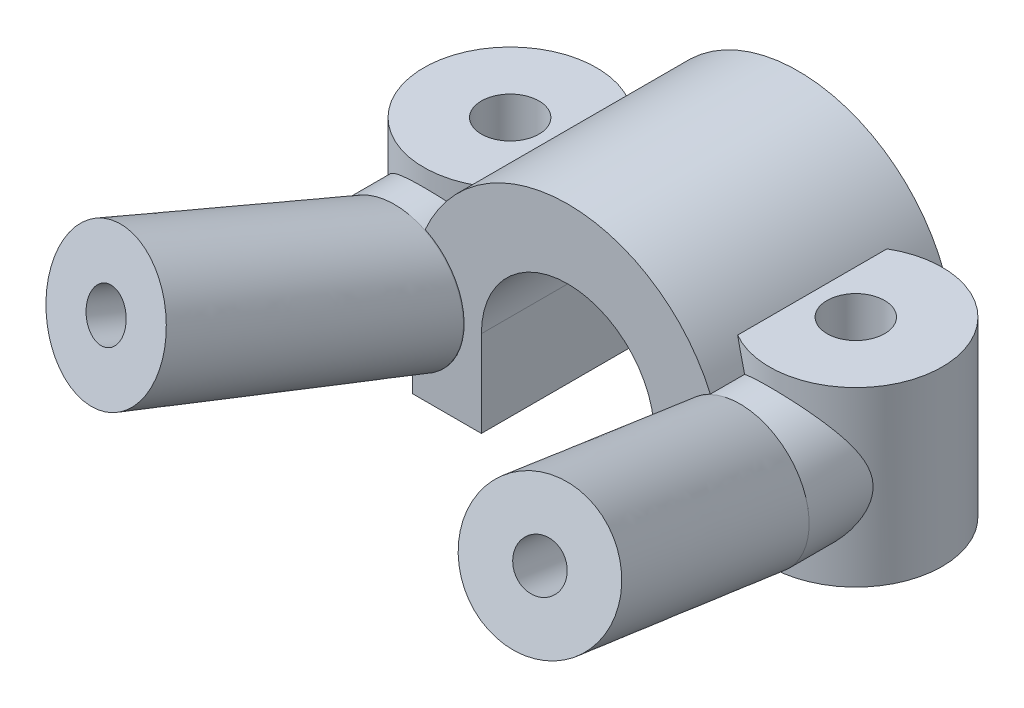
ISO-10303-21;
HEADER;
FILE_DESCRIPTION(('STEP AP214'),'2;1');
FILE_NAME('part.step','',(''),(''),'','','');
FILE_SCHEMA(('AUTOMOTIVE_DESIGN { 1 0 10303 214 1 1 1 1 }'));
ENDSEC;
DATA;
#1=APPLICATION_CONTEXT('core data for automotive mechanical design processes');
#2=APPLICATION_PROTOCOL_DEFINITION('international standard','automotive_design',2000,#1);
#3=PRODUCT_CONTEXT('',#1,'mechanical');
#4=PRODUCT('Part','Part','',(#3));
#5=PRODUCT_RELATED_PRODUCT_CATEGORY('part','',(#4));
#6=PRODUCT_DEFINITION_FORMATION('','',#4);
#7=PRODUCT_DEFINITION_CONTEXT('part definition',#1,'design');
#8=PRODUCT_DEFINITION('design','',#6,#7);
#9=PRODUCT_DEFINITION_SHAPE('','',#8);
#10=(LENGTH_UNIT() NAMED_UNIT(*) SI_UNIT(.MILLI.,.METRE.));
#11=(NAMED_UNIT(*) PLANE_ANGLE_UNIT() SI_UNIT($,.RADIAN.));
#12=(NAMED_UNIT(*) SI_UNIT($,.STERADIAN.) SOLID_ANGLE_UNIT());
#13=UNCERTAINTY_MEASURE_WITH_UNIT(LENGTH_MEASURE(1.E-05),#10,'distance_accuracy_value','');
#14=(GEOMETRIC_REPRESENTATION_CONTEXT(3) GLOBAL_UNCERTAINTY_ASSIGNED_CONTEXT((#13)) GLOBAL_UNIT_ASSIGNED_CONTEXT((#10,
#11,#12)) REPRESENTATION_CONTEXT('',''));
#15=CARTESIAN_POINT('',(0.,0.,0.));
#16=DIRECTION('',(0.,0.,1.));
#17=DIRECTION('',(1.,0.,0.));
#18=AXIS2_PLACEMENT_3D('',#15,#16,#17);
#19=CARTESIAN_POINT('',(0.,1.5,2.));
#20=DIRECTION('',(0.,0.,-1.));
#21=DIRECTION('',(-1.,0.,0.));
#22=AXIS2_PLACEMENT_3D('',#19,#20,#21);
#23=CYLINDRICAL_SURFACE('',#22,2.7);
#24=CARTESIAN_POINT('',(0.,1.5,2.));
#25=DIRECTION('',(0.,0.,1.));
#26=DIRECTION('',(1.,0.,0.));
#27=AXIS2_PLACEMENT_3D('',#24,#25,#26);
#28=CIRCLE('',#27,2.7);
#29=CARTESIAN_POINT('',(2.475,2.57906209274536,2.));
#30=VERTEX_POINT('',#29);
#31=CARTESIAN_POINT('',(-2.475,2.57906209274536,2.));
#32=VERTEX_POINT('',#31);
#33=EDGE_CURVE('E318',#30,#32,#28,.T.);
#34=ORIENTED_EDGE('',*,*,#33,.F.);
#35=DIRECTION('',(0.,0.,-1.));
#36=VECTOR('',#35,1.);
#37=CARTESIAN_POINT('',(2.475,2.57906209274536,1.));
#38=LINE('',#37,#36);
#39=CARTESIAN_POINT('',(2.475,2.57906209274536,1.40512454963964));
#40=VERTEX_POINT('',#39);
#41=EDGE_CURVE('E256',#30,#40,#38,.T.);
#42=ORIENTED_EDGE('',*,*,#41,.T.);
#43=CARTESIAN_POINT('',(2.24499443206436,3.,1.29613525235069));
#44=CARTESIAN_POINT('',(2.27895968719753,2.94921186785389,1.31589237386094));
#45=CARTESIAN_POINT('',(2.31157467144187,2.89662070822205,1.33313260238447));
#46=CARTESIAN_POINT('',(2.37353165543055,2.78848242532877,1.36335670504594));
#47=CARTESIAN_POINT('',(2.40287870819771,2.73294006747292,1.37634721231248));
#48=CARTESIAN_POINT('',(2.45767463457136,2.61972251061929,1.39883951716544));
#49=CARTESIAN_POINT('',(2.48314554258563,2.56206187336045,1.40836149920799));
#50=CARTESIAN_POINT('',(2.5301022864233,2.44476303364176,1.42471459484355));
#51=CARTESIAN_POINT('',(2.55158664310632,2.3851241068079,1.43154471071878));
#52=CARTESIAN_POINT('',(2.60783843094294,2.20973972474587,1.44834988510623));
#53=CARTESIAN_POINT('',(2.63710123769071,2.09192117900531,1.45560243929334));
#54=CARTESIAN_POINT('',(2.679573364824,1.85305039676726,1.46553884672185));
#55=CARTESIAN_POINT('',(2.69275236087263,1.73199249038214,1.46821407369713));
#56=CARTESIAN_POINT('',(2.70071233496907,1.53801614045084,1.4698365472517));
#57=CARTESIAN_POINT('',(2.70075547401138,1.46528350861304,1.46984929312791));
#58=CARTESIAN_POINT('',(2.69497571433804,1.32004245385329,1.46866380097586));
#59=CARTESIAN_POINT('',(2.68915224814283,1.24753405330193,1.46746544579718));
#60=CARTESIAN_POINT('',(2.6716900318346,1.10333571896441,1.46365676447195));
#61=CARTESIAN_POINT('',(2.6600572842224,1.03164501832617,1.46104789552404));
#62=CARTESIAN_POINT('',(2.63107833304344,0.889520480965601,1.4540012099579));
#63=CARTESIAN_POINT('',(2.61373264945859,0.819086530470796,1.44956355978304));
#64=CARTESIAN_POINT('',(2.57415370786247,0.682300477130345,1.43842395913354));
#65=CARTESIAN_POINT('',(2.55209955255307,0.61589027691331,1.43180110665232));
#66=CARTESIAN_POINT('',(2.503059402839,0.485329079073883,1.41552665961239));
#67=CARTESIAN_POINT('',(2.47607594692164,0.421176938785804,1.40587662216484));
#68=CARTESIAN_POINT('',(2.41738773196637,0.295401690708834,1.38259562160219));
#69=CARTESIAN_POINT('',(2.38566069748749,0.233792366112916,1.36894556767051));
#70=CARTESIAN_POINT('',(2.31817773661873,0.114056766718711,1.33659783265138));
#71=CARTESIAN_POINT('',(2.28241389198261,0.0559376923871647,1.31789012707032));
#72=CARTESIAN_POINT('',(2.2449944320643,-1.5185420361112E-13,1.2961352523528));
#73=B_SPLINE_CURVE_WITH_KNOTS('',3,(#43,#44,#45,#46,#47,#48,#49,#50,#51,#52,#53,#54,#55,#56,#57,
#58,#59,#60,#61,#62,#63,#64,#65,#66,#67,#68,#69,#70,#71,#72),.UNSPECIFIED.,.F.,.F.,(4,2,2,2,2,2,
2,2,2,2,2,2,2,2,4),(0.,0.192464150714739,0.384626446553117,0.575651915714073,0.766748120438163,
1.13025959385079,1.49445537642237,1.71243398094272,1.93043367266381,2.14820857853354,
2.36596366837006,2.57657172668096,2.78707163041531,2.9985930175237,3.21053676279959),.UNSPECIFIED.);
#74=CARTESIAN_POINT('',(2.24499443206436,3.,1.29613525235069));
#75=VERTEX_POINT('',#74);
#76=EDGE_CURVE('E265',#75,#40,#73,.T.);
#77=ORIENTED_EDGE('',*,*,#76,.F.);
#78=DIRECTION('',(0.,0.,-1.));
#79=VECTOR('',#78,1.);
#80=CARTESIAN_POINT('',(2.24499443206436,3.,2.));
#81=LINE('',#80,#79);
#82=CARTESIAN_POINT('',(2.24499443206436,3.,-1.29613525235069));
#83=VERTEX_POINT('',#82);
#84=EDGE_CURVE('E56',#75,#83,#81,.T.);
#85=ORIENTED_EDGE('',*,*,#84,.T.);
#86=CARTESIAN_POINT('',(2.24499443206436,0.,-1.29613525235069));
#87=CARTESIAN_POINT('',(2.27895968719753,0.0507881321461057,-1.31589237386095));
#88=CARTESIAN_POINT('',(2.31157467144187,0.103379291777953,-1.33313260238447));
#89=CARTESIAN_POINT('',(2.37353165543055,0.211517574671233,-1.36335670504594));
#90=CARTESIAN_POINT('',(2.40287870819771,0.267059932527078,-1.37634721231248));
#91=CARTESIAN_POINT('',(2.45767463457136,0.380277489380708,-1.39883951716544));
#92=CARTESIAN_POINT('',(2.48314554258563,0.437938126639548,-1.408361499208));
#93=CARTESIAN_POINT('',(2.5301022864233,0.555236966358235,-1.42471459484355));
#94=CARTESIAN_POINT('',(2.55158664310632,0.614875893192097,-1.43154471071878));
#95=CARTESIAN_POINT('',(2.60783843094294,0.790260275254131,-1.44834988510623));
#96=CARTESIAN_POINT('',(2.63710123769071,0.908078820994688,-1.45560243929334));
#97=CARTESIAN_POINT('',(2.679573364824,1.14694960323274,-1.46553884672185));
#98=CARTESIAN_POINT('',(2.69275236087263,1.26800750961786,-1.46821407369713));
#99=CARTESIAN_POINT('',(2.70071233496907,1.46198385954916,-1.4698365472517));
#100=CARTESIAN_POINT('',(2.70075547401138,1.53471649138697,-1.46984929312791));
#101=CARTESIAN_POINT('',(2.69497571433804,1.67995754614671,-1.46866380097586));
#102=CARTESIAN_POINT('',(2.68915224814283,1.75246594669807,-1.46746544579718));
#103=CARTESIAN_POINT('',(2.6716900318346,1.89666428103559,-1.46365676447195));
#104=CARTESIAN_POINT('',(2.6600572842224,1.96835498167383,-1.46104789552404));
#105=CARTESIAN_POINT('',(2.63107833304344,2.1104795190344,-1.4540012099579));
#106=CARTESIAN_POINT('',(2.61373264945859,2.1809134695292,-1.44956355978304));
#107=CARTESIAN_POINT('',(2.57415370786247,2.31769952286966,-1.43842395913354));
#108=CARTESIAN_POINT('',(2.55209955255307,2.38410972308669,-1.43180110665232));
#109=CARTESIAN_POINT('',(2.503059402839,2.51467092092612,-1.41552665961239));
#110=CARTESIAN_POINT('',(2.47607594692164,2.5788230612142,-1.40587662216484));
#111=CARTESIAN_POINT('',(2.41738773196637,2.70459830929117,-1.38259562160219));
#112=CARTESIAN_POINT('',(2.38566069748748,2.76620763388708,-1.36894556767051));
#113=CARTESIAN_POINT('',(2.31817773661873,2.88594323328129,-1.33659783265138));
#114=CARTESIAN_POINT('',(2.28241389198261,2.94406230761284,-1.31789012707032));
#115=CARTESIAN_POINT('',(2.2449944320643,3.00000000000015,-1.2961352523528));
#116=B_SPLINE_CURVE_WITH_KNOTS('',3,(#86,#87,#88,#89,#90,#91,#92,#93,#94,#95,#96,#97,#98,#99,
#100,#101,#102,#103,#104,#105,#106,#107,#108,#109,#110,#111,#112,#113,#114,#115),.UNSPECIFIED.,
.F.,.F.,(4,2,2,2,2,2,2,2,2,2,2,2,2,2,4),(0.,0.19246415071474,0.384626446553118,
0.575651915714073,0.766748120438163,1.13025959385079,1.49445537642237,1.71243398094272,
1.93043367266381,2.14820857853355,2.36596366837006,2.57657172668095,2.7870716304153,
2.9985930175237,3.21053676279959),.UNSPECIFIED.);
#117=CARTESIAN_POINT('',(2.7,1.5,-1.46969384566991));
#118=VERTEX_POINT('',#117);
#119=EDGE_CURVE('E274',#118,#83,#116,.T.);
#120=ORIENTED_EDGE('',*,*,#119,.F.);
#121=DIRECTION('',(0.,0.,-1.));
#122=VECTOR('',#121,1.);
#123=CARTESIAN_POINT('',(2.7,1.5,2.));
#124=LINE('',#123,#122);
#125=CARTESIAN_POINT('',(2.7,1.5,-2.));
#126=VERTEX_POINT('',#125);
#127=EDGE_CURVE('E341',#118,#126,#124,.T.);
#128=ORIENTED_EDGE('',*,*,#127,.T.);
#129=CARTESIAN_POINT('',(0.,1.5,-2.));
#130=DIRECTION('',(0.,0.,1.));
#131=DIRECTION('',(1.,0.,0.));
#132=AXIS2_PLACEMENT_3D('',#129,#130,#131);
#133=CIRCLE('',#132,2.7);
#134=CARTESIAN_POINT('',(-2.7,1.5,-2.));
#135=VERTEX_POINT('',#134);
#136=EDGE_CURVE('E342',#126,#135,#133,.T.);
#137=ORIENTED_EDGE('',*,*,#136,.T.);
#138=DIRECTION('',(0.,0.,-1.));
#139=VECTOR('',#138,1.);
#140=CARTESIAN_POINT('',(-2.7,1.5,2.));
#141=LINE('',#140,#139);
#142=CARTESIAN_POINT('',(-2.7,1.5,-1.46969384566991));
#143=VERTEX_POINT('',#142);
#144=EDGE_CURVE('E373',#143,#135,#141,.T.);
#145=ORIENTED_EDGE('',*,*,#144,.F.);
#146=CARTESIAN_POINT('',(-2.24499443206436,0.,-1.29613525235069));
#147=CARTESIAN_POINT('',(-2.27895968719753,0.050788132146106,-1.31589237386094));
#148=CARTESIAN_POINT('',(-2.31157467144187,0.103379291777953,-1.33313260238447));
#149=CARTESIAN_POINT('',(-2.37353165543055,0.211517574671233,-1.36335670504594));
#150=CARTESIAN_POINT('',(-2.40287870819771,0.267059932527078,-1.37634721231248));
#151=CARTESIAN_POINT('',(-2.45767463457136,0.380277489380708,-1.39883951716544));
#152=CARTESIAN_POINT('',(-2.48314554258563,0.437938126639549,-1.408361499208));
#153=CARTESIAN_POINT('',(-2.5301022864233,0.555236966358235,-1.42471459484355));
#154=CARTESIAN_POINT('',(-2.55158664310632,0.614875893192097,-1.43154471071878));
#155=CARTESIAN_POINT('',(-2.60783843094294,0.790260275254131,-1.44834988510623));
#156=CARTESIAN_POINT('',(-2.63710123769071,0.908078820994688,-1.45560243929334));
#157=CARTESIAN_POINT('',(-2.679573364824,1.14694960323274,-1.46553884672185));
#158=CARTESIAN_POINT('',(-2.69275236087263,1.26800750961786,-1.46821407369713));
#159=CARTESIAN_POINT('',(-2.70071233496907,1.46198385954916,-1.4698365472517));
#160=CARTESIAN_POINT('',(-2.70075547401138,1.53471649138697,-1.46984929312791));
#161=CARTESIAN_POINT('',(-2.69497571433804,1.67995754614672,-1.46866380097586));
#162=CARTESIAN_POINT('',(-2.68915224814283,1.75246594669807,-1.46746544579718));
#163=CARTESIAN_POINT('',(-2.6716900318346,1.89666428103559,-1.46365676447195));
#164=CARTESIAN_POINT('',(-2.6600572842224,1.96835498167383,-1.46104789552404));
#165=CARTESIAN_POINT('',(-2.63107833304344,2.1104795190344,-1.4540012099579));
#166=CARTESIAN_POINT('',(-2.61373264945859,2.1809134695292,-1.44956355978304));
#167=CARTESIAN_POINT('',(-2.57415370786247,2.31769952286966,-1.43842395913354));
#168=CARTESIAN_POINT('',(-2.55209955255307,2.38410972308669,-1.43180110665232));
#169=CARTESIAN_POINT('',(-2.503059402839,2.51467092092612,-1.41552665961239));
#170=CARTESIAN_POINT('',(-2.47607594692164,2.5788230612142,-1.40587662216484));
#171=CARTESIAN_POINT('',(-2.41738773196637,2.70459830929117,-1.38259562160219));
#172=CARTESIAN_POINT('',(-2.38566069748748,2.76620763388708,-1.36894556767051));
#173=CARTESIAN_POINT('',(-2.31817773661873,2.88594323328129,-1.33659783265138));
#174=CARTESIAN_POINT('',(-2.28241389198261,2.94406230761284,-1.31789012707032));
#175=CARTESIAN_POINT('',(-2.2449944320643,3.00000000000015,-1.2961352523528));
#176=B_SPLINE_CURVE_WITH_KNOTS('',3,(#146,#147,#148,#149,#150,#151,#152,#153,#154,#155,#156,
#157,#158,#159,#160,#161,#162,#163,#164,#165,#166,#167,#168,#169,#170,#171,#172,#173,#174,#175),
.UNSPECIFIED.,.F.,.F.,(4,2,2,2,2,2,2,2,2,2,2,2,2,2,4),(0.,0.19246415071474,0.384626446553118,
0.575651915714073,0.766748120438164,1.13025959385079,1.49445537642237,1.71243398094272,
1.93043367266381,2.14820857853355,2.36596366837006,2.57657172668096,2.7870716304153,
2.9985930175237,3.2105367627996),.UNSPECIFIED.);
#177=CARTESIAN_POINT('',(-2.24499443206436,3.,-1.29613525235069));
#178=VERTEX_POINT('',#177);
#179=EDGE_CURVE('E441',#143,#178,#176,.T.);
#180=ORIENTED_EDGE('',*,*,#179,.T.);
#181=DIRECTION('',(0.,0.,-1.));
#182=VECTOR('',#181,1.);
#183=CARTESIAN_POINT('',(-2.24499443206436,3.,2.));
#184=LINE('',#183,#182);
#185=CARTESIAN_POINT('',(-2.24499443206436,3.,1.29613525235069));
#186=VERTEX_POINT('',#185);
#187=EDGE_CURVE('E410',#186,#178,#184,.T.);
#188=ORIENTED_EDGE('',*,*,#187,.F.);
#189=CARTESIAN_POINT('',(-2.24499443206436,3.,1.29613525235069));
#190=CARTESIAN_POINT('',(-2.27895968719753,2.94921186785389,1.31589237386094));
#191=CARTESIAN_POINT('',(-2.31157467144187,2.89662070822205,1.33313260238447));
#192=CARTESIAN_POINT('',(-2.37353165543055,2.78848242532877,1.36335670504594));
#193=CARTESIAN_POINT('',(-2.40287870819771,2.73294006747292,1.37634721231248));
#194=CARTESIAN_POINT('',(-2.45767463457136,2.61972251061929,1.39883951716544));
#195=CARTESIAN_POINT('',(-2.48314554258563,2.56206187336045,1.40836149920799));
#196=CARTESIAN_POINT('',(-2.5301022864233,2.44476303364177,1.42471459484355));
#197=CARTESIAN_POINT('',(-2.55158664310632,2.3851241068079,1.43154471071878));
#198=CARTESIAN_POINT('',(-2.60783843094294,2.20973972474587,1.44834988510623));
#199=CARTESIAN_POINT('',(-2.63710123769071,2.09192117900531,1.45560243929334));
#200=CARTESIAN_POINT('',(-2.679573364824,1.85305039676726,1.46553884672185));
#201=CARTESIAN_POINT('',(-2.69275236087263,1.73199249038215,1.46821407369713));
#202=CARTESIAN_POINT('',(-2.70071233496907,1.53801614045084,1.4698365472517));
#203=CARTESIAN_POINT('',(-2.70075547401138,1.46528350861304,1.46984929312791));
#204=CARTESIAN_POINT('',(-2.69497571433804,1.32004245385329,1.46866380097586));
#205=CARTESIAN_POINT('',(-2.68915224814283,1.24753405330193,1.46746544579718));
#206=CARTESIAN_POINT('',(-2.6716900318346,1.10333571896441,1.46365676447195));
#207=CARTESIAN_POINT('',(-2.6600572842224,1.03164501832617,1.46104789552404));
#208=CARTESIAN_POINT('',(-2.63107833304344,0.889520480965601,1.4540012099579));
#209=CARTESIAN_POINT('',(-2.61373264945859,0.819086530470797,1.44956355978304));
#210=CARTESIAN_POINT('',(-2.57415370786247,0.682300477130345,1.43842395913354));
#211=CARTESIAN_POINT('',(-2.55209955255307,0.61589027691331,1.43180110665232));
#212=CARTESIAN_POINT('',(-2.503059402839,0.485329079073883,1.41552665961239));
#213=CARTESIAN_POINT('',(-2.47607594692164,0.421176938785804,1.40587662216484));
#214=CARTESIAN_POINT('',(-2.41738773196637,0.295401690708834,1.38259562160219));
#215=CARTESIAN_POINT('',(-2.38566069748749,0.233792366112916,1.36894556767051));
#216=CARTESIAN_POINT('',(-2.31817773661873,0.114056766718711,1.33659783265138));
#217=CARTESIAN_POINT('',(-2.28241389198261,0.0559376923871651,1.31789012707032));
#218=CARTESIAN_POINT('',(-2.2449944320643,-1.5157928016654E-13,1.2961352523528));
#219=B_SPLINE_CURVE_WITH_KNOTS('',3,(#189,#190,#191,#192,#193,#194,#195,#196,#197,#198,#199,
#200,#201,#202,#203,#204,#205,#206,#207,#208,#209,#210,#211,#212,#213,#214,#215,#216,#217,#218),
.UNSPECIFIED.,.F.,.F.,(4,2,2,2,2,2,2,2,2,2,2,2,2,2,4),(0.,0.192464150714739,0.384626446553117,
0.575651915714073,0.766748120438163,1.13025959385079,1.49445537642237,1.71243398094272,
1.93043367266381,2.14820857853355,2.36596366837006,2.57657172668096,2.78707163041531,
2.99859301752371,3.2105367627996),.UNSPECIFIED.);
#220=CARTESIAN_POINT('',(-2.475,2.57906209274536,1.40512454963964));
#221=VERTEX_POINT('',#220);
#222=EDGE_CURVE('E434',#186,#221,#219,.T.);
#223=ORIENTED_EDGE('',*,*,#222,.T.);
#224=DIRECTION('',(0.,0.,-1.));
#225=VECTOR('',#224,1.);
#226=CARTESIAN_POINT('',(-2.475,2.57906209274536,1.));
#227=LINE('',#226,#225);
#228=EDGE_CURVE('E321',#32,#221,#227,.T.);
#229=ORIENTED_EDGE('',*,*,#228,.F.);
#230=EDGE_LOOP('',(#34,#42,#77,#85,#120,#128,#137,#145,#180,#188,#223,#229));
#231=FACE_BOUND('',#230,.T.);
#232=ADVANCED_FACE('F44',(#231),#23,.T.);
#233=CARTESIAN_POINT('',(2.7,0.,2.));
#234=DIRECTION('',(-1.,0.,0.));
#235=DIRECTION('',(0.,-1.,0.));
#236=AXIS2_PLACEMENT_3D('',#233,#234,#235);
#237=PLANE('',#236);
#238=DIRECTION('',(0.,-1.,0.));
#239=VECTOR('',#238,1.);
#240=CARTESIAN_POINT('',(2.7,3.,-1.46969384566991));
#241=LINE('',#240,#239);
#242=CARTESIAN_POINT('',(2.7,0.,-1.46969384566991));
#243=VERTEX_POINT('',#242);
#244=EDGE_CURVE('E361',#243,#118,#241,.F.);
#245=ORIENTED_EDGE('',*,*,#244,.F.);
#246=DIRECTION('',(0.,0.,-1.));
#247=VECTOR('',#246,1.);
#248=CARTESIAN_POINT('',(2.7,0.,2.));
#249=LINE('',#248,#247);
#250=CARTESIAN_POINT('',(2.7,0.,-2.));
#251=VERTEX_POINT('',#250);
#252=EDGE_CURVE('E352',#243,#251,#249,.T.);
#253=ORIENTED_EDGE('',*,*,#252,.T.);
#254=DIRECTION('',(0.,1.,0.));
#255=VECTOR('',#254,1.);
#256=CARTESIAN_POINT('',(2.7,0.,-2.));
#257=LINE('',#256,#255);
#258=EDGE_CURVE('E326',#251,#126,#257,.T.);
#259=ORIENTED_EDGE('',*,*,#258,.T.);
#260=ORIENTED_EDGE('',*,*,#127,.F.);
#261=EDGE_LOOP('',(#245,#253,#259,#260));
#262=FACE_BOUND('',#261,.T.);
#263=ADVANCED_FACE('F309',(#262),#237,.F.);
#264=DIRECTION('',(0.,-1.,0.));
#265=VECTOR('',#264,1.);
#266=CARTESIAN_POINT('',(2.7,3.,1.46969384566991));
#267=LINE('',#266,#265);
#268=CARTESIAN_POINT('',(2.7,0.338104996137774,1.46969384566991));
#269=VERTEX_POINT('',#268);
#270=CARTESIAN_POINT('',(2.7,0.,1.46969384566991));
#271=VERTEX_POINT('',#270);
#272=EDGE_CURVE('E360',#269,#271,#267,.T.);
#273=ORIENTED_EDGE('',*,*,#272,.F.);
#274=DIRECTION('',(0.,0.,-1.));
#275=VECTOR('',#274,1.);
#276=CARTESIAN_POINT('',(2.7,0.338104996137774,0.));
#277=LINE('',#276,#275);
#278=CARTESIAN_POINT('',(2.7,0.338104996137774,2.));
#279=VERTEX_POINT('',#278);
#280=EDGE_CURVE('E64',#269,#279,#277,.F.);
#281=ORIENTED_EDGE('',*,*,#280,.T.);
#282=DIRECTION('',(0.,1.,0.));
#283=VECTOR('',#282,1.);
#284=CARTESIAN_POINT('',(2.7,0.,2.));
#285=LINE('',#284,#283);
#286=CARTESIAN_POINT('',(2.7,0.,2.));
#287=VERTEX_POINT('',#286);
#288=EDGE_CURVE('E338',#287,#279,#285,.T.);
#289=ORIENTED_EDGE('',*,*,#288,.F.);
#290=EDGE_CURVE('E353',#287,#271,#249,.T.);
#291=ORIENTED_EDGE('',*,*,#290,.T.);
#292=EDGE_LOOP('',(#273,#281,#289,#291));
#293=FACE_BOUND('',#292,.T.);
#294=ADVANCED_FACE('F313',(#293),#237,.F.);
#295=CARTESIAN_POINT('',(0.,1.5,2.));
#296=DIRECTION('',(0.,0.,-1.));
#297=DIRECTION('',(-1.,0.,0.));
#298=AXIS2_PLACEMENT_3D('',#295,#296,#297);
#299=CYLINDRICAL_SURFACE('',#298,1.5);
#300=CARTESIAN_POINT('',(0.,1.5,-2.));
#301=DIRECTION('',(0.,0.,1.));
#302=DIRECTION('',(1.,0.,0.));
#303=AXIS2_PLACEMENT_3D('',#300,#301,#302);
#304=CIRCLE('',#303,1.5);
#305=CARTESIAN_POINT('',(1.5,1.5,-2.));
#306=VERTEX_POINT('',#305);
#307=CARTESIAN_POINT('',(-1.5,1.5,-2.));
#308=VERTEX_POINT('',#307);
#309=EDGE_CURVE('E344',#306,#308,#304,.T.);
#310=ORIENTED_EDGE('',*,*,#309,.F.);
#311=DIRECTION('',(0.,0.,-1.));
#312=VECTOR('',#311,1.);
#313=CARTESIAN_POINT('',(1.5,1.5,2.));
#314=LINE('',#313,#312);
#315=CARTESIAN_POINT('',(1.5,1.5,2.));
#316=VERTEX_POINT('',#315);
#317=EDGE_CURVE('E358',#316,#306,#314,.T.);
#318=ORIENTED_EDGE('',*,*,#317,.F.);
#319=CARTESIAN_POINT('',(0.,1.5,2.));
#320=DIRECTION('',(0.,0.,1.));
#321=DIRECTION('',(1.,0.,0.));
#322=AXIS2_PLACEMENT_3D('',#319,#320,#321);
#323=CIRCLE('',#322,1.5);
#324=CARTESIAN_POINT('',(-1.5,1.5,2.));
#325=VERTEX_POINT('',#324);
#326=EDGE_CURVE('E325',#316,#325,#323,.T.);
#327=ORIENTED_EDGE('',*,*,#326,.T.);
#328=DIRECTION('',(0.,0.,-1.));
#329=VECTOR('',#328,1.);
#330=CARTESIAN_POINT('',(-1.5,1.5,2.));
#331=LINE('',#330,#329);
#332=EDGE_CURVE('E403',#325,#308,#331,.T.);
#333=ORIENTED_EDGE('',*,*,#332,.T.);
#334=EDGE_LOOP('',(#310,#318,#327,#333));
#335=FACE_BOUND('',#334,.T.);
#336=ADVANCED_FACE('F545',(#335),#299,.F.);
#337=CARTESIAN_POINT('',(1.5,0.,2.));
#338=DIRECTION('',(-1.,0.,0.));
#339=DIRECTION('',(0.,-1.,0.));
#340=AXIS2_PLACEMENT_3D('',#337,#338,#339);
#341=PLANE('',#340);
#342=ORIENTED_EDGE('',*,*,#317,.T.);
#343=DIRECTION('',(0.,1.,0.));
#344=VECTOR('',#343,1.);
#345=CARTESIAN_POINT('',(1.5,0.,-2.));
#346=LINE('',#345,#344);
#347=CARTESIAN_POINT('',(1.5,0.,-2.));
#348=VERTEX_POINT('',#347);
#349=EDGE_CURVE('E346',#348,#306,#346,.T.);
#350=ORIENTED_EDGE('',*,*,#349,.F.);
#351=DIRECTION('',(0.,0.,-1.));
#352=VECTOR('',#351,1.);
#353=CARTESIAN_POINT('',(1.5,0.,2.));
#354=LINE('',#353,#352);
#355=CARTESIAN_POINT('',(1.5,0.,2.));
#356=VERTEX_POINT('',#355);
#357=EDGE_CURVE('E356',#356,#348,#354,.T.);
#358=ORIENTED_EDGE('',*,*,#357,.F.);
#359=DIRECTION('',(0.,1.,0.));
#360=VECTOR('',#359,1.);
#361=CARTESIAN_POINT('',(1.5,0.,2.));
#362=LINE('',#361,#360);
#363=EDGE_CURVE('E327',#356,#316,#362,.T.);
#364=ORIENTED_EDGE('',*,*,#363,.T.);
#365=EDGE_LOOP('',(#342,#350,#358,#364));
#366=FACE_BOUND('',#365,.T.);
#367=ADVANCED_FACE('F549',(#366),#341,.T.);
#368=CARTESIAN_POINT('',(2.7,0.,2.));
#369=DIRECTION('',(0.,-1.,0.));
#370=DIRECTION('',(1.,0.,0.));
#371=AXIS2_PLACEMENT_3D('',#368,#369,#370);
#372=PLANE('',#371);
#373=CARTESIAN_POINT('',(3.,0.,0.));
#374=DIRECTION('',(0.,-1.,0.));
#375=DIRECTION('',(1.,0.,0.));
#376=AXIS2_PLACEMENT_3D('',#373,#374,#375);
#377=CIRCLE('',#376,0.5);
#378=CARTESIAN_POINT('',(3.5,0.,0.));
#379=VERTEX_POINT('',#378);
#380=EDGE_CURVE('E231',#379,#379,#377,.T.);
#381=ORIENTED_EDGE('',*,*,#380,.F.);
#382=EDGE_LOOP('',(#381));
#383=FACE_BOUND('',#382,.T.);
#384=ORIENTED_EDGE('',*,*,#357,.T.);
#385=DIRECTION('',(-1.,0.,0.));
#386=VECTOR('',#385,1.);
#387=CARTESIAN_POINT('',(2.7,0.,-2.));
#388=LINE('',#387,#386);
#389=EDGE_CURVE('E330',#251,#348,#388,.T.);
#390=ORIENTED_EDGE('',*,*,#389,.F.);
#391=ORIENTED_EDGE('',*,*,#252,.F.);
#392=CARTESIAN_POINT('',(3.,0.,0.));
#393=DIRECTION('',(0.,1.,0.));
#394=DIRECTION('',(0.,0.,1.));
#395=AXIS2_PLACEMENT_3D('',#392,#393,#394);
#396=CIRCLE('',#395,1.5);
#397=EDGE_CURVE('E261',#271,#243,#396,.T.);
#398=ORIENTED_EDGE('',*,*,#397,.F.);
#399=ORIENTED_EDGE('',*,*,#290,.F.);
#400=DIRECTION('',(-1.,0.,0.));
#401=VECTOR('',#400,1.);
#402=CARTESIAN_POINT('',(2.7,0.,2.));
#403=LINE('',#402,#401);
#404=EDGE_CURVE('E335',#287,#356,#403,.T.);
#405=ORIENTED_EDGE('',*,*,#404,.T.);
#406=EDGE_LOOP('',(#384,#390,#391,#398,#399,#405));
#407=FACE_BOUND('',#406,.T.);
#408=ADVANCED_FACE('F553',(#383,#407),#372,.T.);
#409=CARTESIAN_POINT('',(0.,1.5,2.));
#410=DIRECTION('',(0.,0.,1.));
#411=DIRECTION('',(1.,0.,0.));
#412=AXIS2_PLACEMENT_3D('',#409,#410,#411);
#413=PLANE('',#412);
#414=CARTESIAN_POINT('',(3.,1.5,2.));
#415=DIRECTION('',(0.,0.,1.));
#416=DIRECTION('',(1.,0.,0.));
#417=AXIS2_PLACEMENT_3D('',#414,#415,#416);
#418=CIRCLE('',#417,1.2);
#419=EDGE_CURVE('E259',#30,#279,#418,.T.);
#420=ORIENTED_EDGE('',*,*,#419,.F.);
#421=ORIENTED_EDGE('',*,*,#33,.T.);
#422=CARTESIAN_POINT('',(-3.,1.5,2.));
#423=DIRECTION('',(0.,0.,-1.));
#424=DIRECTION('',(-1.,0.,0.));
#425=AXIS2_PLACEMENT_3D('',#422,#423,#424);
#426=CIRCLE('',#425,1.2);
#427=CARTESIAN_POINT('',(-2.7,0.338104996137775,2.));
#428=VERTEX_POINT('',#427);
#429=EDGE_CURVE('E787',#32,#428,#426,.T.);
#430=ORIENTED_EDGE('',*,*,#429,.T.);
#431=DIRECTION('',(0.,1.,0.));
#432=VECTOR('',#431,1.);
#433=CARTESIAN_POINT('',(-2.7,0.,2.));
#434=LINE('',#433,#432);
#435=CARTESIAN_POINT('',(-2.7,0.,2.));
#436=VERTEX_POINT('',#435);
#437=EDGE_CURVE('E390',#436,#428,#434,.T.);
#438=ORIENTED_EDGE('',*,*,#437,.F.);
#439=DIRECTION('',(1.,0.,0.));
#440=VECTOR('',#439,1.);
#441=CARTESIAN_POINT('',(-2.7,0.,2.));
#442=LINE('',#441,#440);
#443=CARTESIAN_POINT('',(-1.5,0.,2.));
#444=VERTEX_POINT('',#443);
#445=EDGE_CURVE('E395',#436,#444,#442,.T.);
#446=ORIENTED_EDGE('',*,*,#445,.T.);
#447=DIRECTION('',(0.,1.,0.));
#448=VECTOR('',#447,1.);
#449=CARTESIAN_POINT('',(-1.5,0.,2.));
#450=LINE('',#449,#448);
#451=EDGE_CURVE('E383',#444,#325,#450,.T.);
#452=ORIENTED_EDGE('',*,*,#451,.T.);
#453=ORIENTED_EDGE('',*,*,#326,.F.);
#454=ORIENTED_EDGE('',*,*,#363,.F.);
#455=ORIENTED_EDGE('',*,*,#404,.F.);
#456=ORIENTED_EDGE('',*,*,#288,.T.);
#457=EDGE_LOOP('',(#420,#421,#430,#438,#446,#452,#453,#454,#455,#456));
#458=FACE_BOUND('',#457,.T.);
#459=ADVANCED_FACE('F287',(#458),#413,.T.);
#460=CARTESIAN_POINT('',(0.,1.5,-2.));
#461=DIRECTION('',(0.,0.,1.));
#462=DIRECTION('',(1.,0.,0.));
#463=AXIS2_PLACEMENT_3D('',#460,#461,#462);
#464=PLANE('',#463);
#465=ORIENTED_EDGE('',*,*,#136,.F.);
#466=ORIENTED_EDGE('',*,*,#258,.F.);
#467=ORIENTED_EDGE('',*,*,#389,.T.);
#468=ORIENTED_EDGE('',*,*,#349,.T.);
#469=ORIENTED_EDGE('',*,*,#309,.T.);
#470=DIRECTION('',(0.,1.,0.));
#471=VECTOR('',#470,1.);
#472=CARTESIAN_POINT('',(-1.5,0.,-2.));
#473=LINE('',#472,#471);
#474=CARTESIAN_POINT('',(-1.5,0.,-2.));
#475=VERTEX_POINT('',#474);
#476=EDGE_CURVE('E446',#475,#308,#473,.T.);
#477=ORIENTED_EDGE('',*,*,#476,.F.);
#478=DIRECTION('',(1.,0.,0.));
#479=VECTOR('',#478,1.);
#480=CARTESIAN_POINT('',(-2.7,0.,-2.));
#481=LINE('',#480,#479);
#482=CARTESIAN_POINT('',(-2.7,0.,-2.));
#483=VERTEX_POINT('',#482);
#484=EDGE_CURVE('E379',#483,#475,#481,.T.);
#485=ORIENTED_EDGE('',*,*,#484,.F.);
#486=DIRECTION('',(0.,1.,0.));
#487=VECTOR('',#486,1.);
#488=CARTESIAN_POINT('',(-2.7,0.,-2.));
#489=LINE('',#488,#487);
#490=EDGE_CURVE('E376',#483,#135,#489,.T.);
#491=ORIENTED_EDGE('',*,*,#490,.T.);
#492=EDGE_LOOP('',(#465,#466,#467,#468,#469,#477,#485,#491));
#493=FACE_BOUND('',#492,.T.);
#494=ADVANCED_FACE('F377',(#493),#464,.F.);
#495=CARTESIAN_POINT('',(3.,3.,0.));
#496=DIRECTION('',(0.,1.,0.));
#497=DIRECTION('',(0.,0.,1.));
#498=AXIS2_PLACEMENT_3D('',#495,#496,#497);
#499=PLANE('',#498);
#500=CARTESIAN_POINT('',(3.,3.,0.));
#501=DIRECTION('',(0.,1.,0.));
#502=DIRECTION('',(0.,0.,1.));
#503=AXIS2_PLACEMENT_3D('',#500,#501,#502);
#504=CIRCLE('',#503,0.5);
#505=CARTESIAN_POINT('',(3.,3.,0.5));
#506=VERTEX_POINT('',#505);
#507=EDGE_CURVE('E252',#506,#506,#504,.T.);
#508=ORIENTED_EDGE('',*,*,#507,.F.);
#509=EDGE_LOOP('',(#508));
#510=FACE_BOUND('',#509,.T.);
#511=ORIENTED_EDGE('',*,*,#84,.F.);
#512=CARTESIAN_POINT('',(3.,3.,0.));
#513=DIRECTION('',(0.,1.,0.));
#514=DIRECTION('',(0.,0.,1.));
#515=AXIS2_PLACEMENT_3D('',#512,#513,#514);
#516=CIRCLE('',#515,1.5);
#517=EDGE_CURVE('E262',#75,#83,#516,.T.);
#518=ORIENTED_EDGE('',*,*,#517,.T.);
#519=EDGE_LOOP('',(#511,#518));
#520=FACE_BOUND('',#519,.T.);
#521=ADVANCED_FACE('F285',(#510,#520),#499,.T.);
#522=CARTESIAN_POINT('',(3.,3.,0.));
#523=DIRECTION('',(0.,-1.,0.));
#524=DIRECTION('',(0.,0.,-1.));
#525=AXIS2_PLACEMENT_3D('',#522,#523,#524);
#526=CYLINDRICAL_SURFACE('',#525,1.5);
#527=ORIENTED_EDGE('',*,*,#76,.T.);
#528=CARTESIAN_POINT('',(1.8,1.5,0.9));
#529=CARTESIAN_POINT('',(1.80000602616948,1.54504861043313,0.900013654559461));
#530=CARTESIAN_POINT('',(1.80256654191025,1.59016735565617,0.903453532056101));
#531=CARTESIAN_POINT('',(1.81257389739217,1.67898871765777,0.916558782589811));
#532=CARTESIAN_POINT('',(1.82003750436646,1.72268593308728,0.926245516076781));
#533=CARTESIAN_POINT('',(1.84267026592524,1.82256325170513,0.954469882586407));
#534=CARTESIAN_POINT('',(1.8596184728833,1.87778550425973,0.974915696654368));
#535=CARTESIAN_POINT('',(1.90028152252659,1.98358088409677,1.02056719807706));
#536=CARTESIAN_POINT('',(1.92401543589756,2.03414036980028,1.04578623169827));
#537=CARTESIAN_POINT('',(1.98733346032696,2.14820379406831,1.10774979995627));
#538=CARTESIAN_POINT('',(2.02954581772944,2.20977994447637,1.14536512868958));
#539=CARTESIAN_POINT('',(2.12482838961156,2.32438610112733,1.21972798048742));
#540=CARTESIAN_POINT('',(2.1778895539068,2.37742316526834,1.25647619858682));
#541=CARTESIAN_POINT('',(2.28314384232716,2.46426295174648,1.31874404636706));
#542=CARTESIAN_POINT('',(2.33343974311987,2.49979576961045,1.34504808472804));
#543=CARTESIAN_POINT('',(2.44053314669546,2.56341957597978,1.3929909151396));
#544=CARTESIAN_POINT('',(2.49732034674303,2.59152212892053,1.41463694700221));
#545=CARTESIAN_POINT('',(2.60680975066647,2.6350277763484,1.44849386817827));
#546=CARTESIAN_POINT('',(2.65868784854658,2.65174953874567,1.46166441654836));
#547=CARTESIAN_POINT('',(2.76528716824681,2.6780992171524,1.48251547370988));
#548=CARTESIAN_POINT('',(2.82000681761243,2.68773101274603,1.49019898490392));
#549=CARTESIAN_POINT('',(2.93097099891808,2.69931485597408,1.4994478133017));
#550=CARTESIAN_POINT('',(2.98722013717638,2.70124031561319,1.50099194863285));
#551=CARTESIAN_POINT('',(3.09924981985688,2.69720145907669,1.49776161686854));
#552=CARTESIAN_POINT('',(3.15503034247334,2.69123677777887,1.49298685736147));
#553=CARTESIAN_POINT('',(3.26141014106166,2.67235920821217,1.47797019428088));
#554=CARTESIAN_POINT('',(3.3121261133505,2.65984270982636,1.46804042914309));
#555=CARTESIAN_POINT('',(3.41050311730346,2.62878285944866,1.4436269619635));
#556=CARTESIAN_POINT('',(3.45816337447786,2.61023798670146,1.4291421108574));
#557=CARTESIAN_POINT('',(3.55411639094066,2.56583958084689,1.39491733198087));
#558=CARTESIAN_POINT('',(3.60202781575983,2.53945409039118,1.37480559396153));
#559=CARTESIAN_POINT('',(3.69282534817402,2.48127728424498,1.33136426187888));
#560=CARTESIAN_POINT('',(3.73570861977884,2.44948294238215,1.30803286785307));
#561=CARTESIAN_POINT('',(3.82455912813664,2.37416287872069,1.25432106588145));
#562=CARTESIAN_POINT('',(3.86934065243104,2.32956983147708,1.2234788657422));
#563=CARTESIAN_POINT('',(3.95123030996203,2.23424645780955,1.16095426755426));
#564=CARTESIAN_POINT('',(3.98832896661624,2.18350867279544,1.12927088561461));
#565=CARTESIAN_POINT('',(4.05137117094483,2.08126788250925,1.07064790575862));
#566=CARTESIAN_POINT('',(4.07804504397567,2.03030943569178,1.0435453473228));
#567=CARTESIAN_POINT('',(4.12433464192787,1.92338012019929,0.993492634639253));
#568=CARTESIAN_POINT('',(4.14396579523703,1.86742054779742,0.970533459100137));
#569=CARTESIAN_POINT('',(4.17037319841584,1.76832503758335,0.938362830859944));
#570=CARTESIAN_POINT('',(4.1792417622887,1.72643230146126,0.927093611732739));
#571=CARTESIAN_POINT('',(4.19248186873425,1.64089187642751,0.910003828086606));
#572=CARTESIAN_POINT('',(4.19686343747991,1.59724832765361,0.904171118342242));
#573=CARTESIAN_POINT('',(4.20077996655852,1.50908197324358,0.898966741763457));
#574=CARTESIAN_POINT('',(4.20028683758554,1.46455554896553,0.899632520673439));
#575=CARTESIAN_POINT('',(4.19443566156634,1.37637160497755,0.907382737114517));
#576=CARTESIAN_POINT('',(4.18907074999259,1.33271540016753,0.914476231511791));
#577=CARTESIAN_POINT('',(4.17198858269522,1.23656207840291,0.936309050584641));
#578=CARTESIAN_POINT('',(4.15900255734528,1.1846410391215,0.95253432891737));
#579=CARTESIAN_POINT('',(4.12704833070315,1.08462548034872,0.990136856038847));
#580=CARTESIAN_POINT('',(4.1080622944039,1.03654291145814,1.01152941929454));
#581=CARTESIAN_POINT('',(4.0548456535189,0.923082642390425,1.06741949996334));
#582=CARTESIAN_POINT('',(4.01761506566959,0.859862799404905,1.10343338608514));
#583=CARTESIAN_POINT('',(3.93262823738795,0.741369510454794,1.1761611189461));
#584=CARTESIAN_POINT('',(3.88485960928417,0.686105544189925,1.21287574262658));
#585=CARTESIAN_POINT('',(3.77821382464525,0.583522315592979,1.28395979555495));
#586=CARTESIAN_POINT('',(3.71918916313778,0.536326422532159,1.31828872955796));
#587=CARTESIAN_POINT('',(3.59098216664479,0.452840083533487,1.38049827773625));
#588=CARTESIAN_POINT('',(3.52183392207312,0.416514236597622,1.40839975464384));
#589=CARTESIAN_POINT('',(3.39871919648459,0.366905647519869,1.4469789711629));
#590=CARTESIAN_POINT('',(3.347044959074,0.349969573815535,1.46030952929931));
#591=CARTESIAN_POINT('',(3.24081922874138,0.323140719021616,1.48152930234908));
#592=CARTESIAN_POINT('',(3.18626996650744,0.313242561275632,1.48942267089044));
#593=CARTESIAN_POINT('',(3.07557681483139,0.301084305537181,1.49912819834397));
#594=CARTESIAN_POINT('',(3.01942785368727,0.298852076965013,1.50091816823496));
#595=CARTESIAN_POINT('',(2.90752230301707,0.302259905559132,1.49819231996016));
#596=CARTESIAN_POINT('',(2.85176574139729,0.307900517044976,1.49367605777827));
#597=CARTESIAN_POINT('',(2.7453090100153,0.326162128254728,1.47914405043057));
#598=CARTESIAN_POINT('',(2.69449790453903,0.338393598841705,1.4694354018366));
#599=CARTESIAN_POINT('',(2.59588767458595,0.368912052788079,1.44543121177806));
#600=CARTESIAN_POINT('',(2.54808933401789,0.387200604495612,1.4311344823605));
#601=CARTESIAN_POINT('',(2.45196984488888,0.431024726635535,1.39731721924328));
#602=CARTESIAN_POINT('',(2.40401394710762,0.457076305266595,1.37743438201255));
#603=CARTESIAN_POINT('',(2.31308162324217,0.514585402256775,1.33442037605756));
#604=CARTESIAN_POINT('',(2.27010786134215,0.546045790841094,1.31128748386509));
#605=CARTESIAN_POINT('',(2.18107065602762,0.620577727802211,1.25800111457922));
#606=CARTESIAN_POINT('',(2.13617517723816,0.664707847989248,1.22737979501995));
#607=CARTESIAN_POINT('',(2.05398388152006,0.759070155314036,1.16520787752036));
#608=CARTESIAN_POINT('',(2.01669762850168,0.809309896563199,1.133656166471));
#609=CARTESIAN_POINT('',(1.95269243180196,0.911374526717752,1.07465475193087));
#610=CARTESIAN_POINT('',(1.92536315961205,0.96274351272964,1.04707957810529));
#611=CARTESIAN_POINT('',(1.87790217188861,1.07063513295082,0.996044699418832));
#612=CARTESIAN_POINT('',(1.85775698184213,1.12714786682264,0.972577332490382));
#613=CARTESIAN_POINT('',(1.83051516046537,1.2276835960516,0.939480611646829));
#614=CARTESIAN_POINT('',(1.82132117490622,1.27045172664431,0.927811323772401));
#615=CARTESIAN_POINT('',(1.80764230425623,1.35781456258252,0.910172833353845));
#616=CARTESIAN_POINT('',(1.80313949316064,1.40240163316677,0.904181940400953));
#617=CARTESIAN_POINT('',(1.80038554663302,1.4647951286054,0.900512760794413));
#618=CARTESIAN_POINT('',(1.79999764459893,1.48239220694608,0.899994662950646));
#619=CARTESIAN_POINT('',(1.8,1.5,0.9));
#620=B_SPLINE_CURVE_WITH_KNOTS('',3,(#528,#529,#530,#531,#532,#533,#534,#535,#536,#537,#538,
#539,#540,#541,#542,#543,#544,#545,#546,#547,#548,#549,#550,#551,#552,#553,#554,#555,#556,#557,
#558,#559,#560,#561,#562,#563,#564,#565,#566,#567,#568,#569,#570,#571,#572,#573,#574,#575,#576,
#577,#578,#579,#580,#581,#582,#583,#584,#585,#586,#587,#588,#589,#590,#591,#592,#593,#594,#595,
#596,#597,#598,#599,#600,#601,#602,#603,#604,#605,#606,#607,#608,#609,#610,#611,#612,#613,#614,
#615,#616,#617,#618,#619),.UNSPECIFIED.,.T.,.F.,(4,2,2,2,2,2,2,2,2,2,2,2,2,2,2,2,2,2,2,2,2,2,2,
2,2,2,2,2,2,2,2,2,2,2,2,2,2,2,2,2,2,2,2,2,2,4),(0.,0.135084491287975,0.27063335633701,
0.453428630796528,0.636742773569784,0.886324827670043,1.13569952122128,1.33583581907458,
1.53565876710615,1.70317256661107,1.87059463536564,2.03859383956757,2.20660081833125,
2.36545150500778,2.52434229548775,2.69853906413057,2.87283361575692,3.08304735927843,
3.2935188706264,3.4837151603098,3.67349220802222,3.80584635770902,3.9379041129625,
4.07072326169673,4.20372984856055,4.37057136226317,4.53791355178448,4.781854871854,
5.02608449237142,5.27376704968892,5.52063396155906,5.68791556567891,5.85506923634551,
6.02282995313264,6.19060248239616,6.34940065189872,6.50823997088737,6.68186015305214,
6.85557275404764,7.06484111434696,7.27437090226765,7.46697444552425,7.65921481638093,
7.79454829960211,7.92936272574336,7.98216212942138),.UNSPECIFIED.);
#621=EDGE_CURVE('E12',#40,#269,#620,.T.);
#622=ORIENTED_EDGE('',*,*,#621,.T.);
#623=ORIENTED_EDGE('',*,*,#272,.T.);
#624=ORIENTED_EDGE('',*,*,#397,.T.);
#625=ORIENTED_EDGE('',*,*,#244,.T.);
#626=ORIENTED_EDGE('',*,*,#119,.T.);
#627=ORIENTED_EDGE('',*,*,#517,.F.);
#628=EDGE_LOOP('',(#527,#622,#623,#624,#625,#626,#627));
#629=FACE_BOUND('',#628,.T.);
#630=ADVANCED_FACE('F279',(#629),#526,.T.);
#631=CARTESIAN_POINT('',(3.,1.5,0.));
#632=DIRECTION('',(0.,0.,-1.));
#633=DIRECTION('',(-1.,0.,0.));
#634=AXIS2_PLACEMENT_3D('',#631,#632,#633);
#635=CYLINDRICAL_SURFACE('',#634,1.2);
#636=ORIENTED_EDGE('',*,*,#41,.F.);
#637=ORIENTED_EDGE('',*,*,#419,.T.);
#638=ORIENTED_EDGE('',*,*,#280,.F.);
#639=ORIENTED_EDGE('',*,*,#621,.F.);
#640=EDGE_LOOP('',(#636,#637,#638,#639));
#641=FACE_BOUND('',#640,.T.);
#642=CARTESIAN_POINT('',(3.,1.5,2.01));
#643=DIRECTION('',(0.,0.,-1.));
#644=DIRECTION('',(-1.,0.,0.));
#645=AXIS2_PLACEMENT_3D('',#642,#643,#644);
#646=CIRCLE('',#645,1.2);
#647=CARTESIAN_POINT('',(3.17728843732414,2.68683141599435,2.01));
#648=VERTEX_POINT('',#647);
#649=EDGE_CURVE('E223',#648,#648,#646,.T.);
#650=ORIENTED_EDGE('',*,*,#649,.T.);
#651=EDGE_LOOP('',(#650));
#652=FACE_BOUND('',#651,.T.);
#653=ADVANCED_FACE('F284',(#641,#652),#635,.T.);
#654=CARTESIAN_POINT('',(3.,4.2,0.));
#655=DIRECTION('',(0.,-1.,0.));
#656=DIRECTION('',(1.,0.,0.));
#657=AXIS2_PLACEMENT_3D('',#654,#655,#656);
#658=CYLINDRICAL_SURFACE('',#657,0.5);
#659=ORIENTED_EDGE('',*,*,#507,.T.);
#660=EDGE_LOOP('',(#659));
#661=FACE_BOUND('',#660,.T.);
#662=ORIENTED_EDGE('',*,*,#380,.T.);
#663=EDGE_LOOP('',(#662));
#664=FACE_BOUND('',#663,.T.);
#665=ADVANCED_FACE('F298',(#661,#664),#658,.F.);
#666=CARTESIAN_POINT('',(3.7657894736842,2.76812832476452,6.24916662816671));
#667=DIRECTION('',(-0.170175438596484,-0.281806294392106,-0.944259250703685));
#668=DIRECTION('',(0.,0.958236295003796,-0.285977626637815));
#669=AXIS2_PLACEMENT_3D('',#666,#667,#668);
#670=PLANE('',#669);
#671=CARTESIAN_POINT('',(3.7657894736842,2.76812832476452,6.24916662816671));
#672=DIRECTION('',(0.170175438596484,0.281806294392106,0.944259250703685));
#673=DIRECTION('',(0.,-0.958236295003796,0.285977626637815));
#674=AXIS2_PLACEMENT_3D('',#671,#672,#673);
#675=CIRCLE('',#674,0.4);
#676=CARTESIAN_POINT('',(3.7657894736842,2.384833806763,6.36355767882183));
#677=VERTEX_POINT('',#676);
#678=EDGE_CURVE('E418',#677,#677,#675,.T.);
#679=ORIENTED_EDGE('',*,*,#678,.F.);
#680=EDGE_LOOP('',(#679));
#681=FACE_BOUND('',#680,.T.);
#682=CARTESIAN_POINT('',(3.7657894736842,2.76812832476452,6.24916662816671));
#683=DIRECTION('',(-0.170175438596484,-0.281806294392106,-0.944259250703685));
#684=DIRECTION('',(0.,0.958236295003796,-0.285977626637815));
#685=AXIS2_PLACEMENT_3D('',#682,#683,#684);
#686=CIRCLE('',#685,1.2);
#687=CARTESIAN_POINT('',(3.92164111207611,3.90028385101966,5.88319650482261));
#688=VERTEX_POINT('',#687);
#689=EDGE_CURVE('E232',#688,#688,#686,.T.);
#690=ORIENTED_EDGE('',*,*,#689,.F.);
#691=EDGE_LOOP('',(#690));
#692=FACE_BOUND('',#691,.T.);
#693=ADVANCED_FACE('F203',(#681,#692),#670,.F.);
#694=CARTESIAN_POINT('',(3.17728843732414,2.68683141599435,2.01));
#695=CARTESIAN_POINT('',(3.92164111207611,3.90028385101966,5.88319650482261));
#696=CARTESIAN_POINT('',(3.07838581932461,2.70160545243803,2.01));
#697=CARTESIAN_POINT('',(3.82395936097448,3.91773747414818,5.89559192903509));
#698=CARTESIAN_POINT('',(2.96471065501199,2.70629128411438,2.01));
#699=CARTESIAN_POINT('',(3.71188246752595,3.92600850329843,5.91332213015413));
#700=CARTESIAN_POINT('',(2.71105755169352,2.6717065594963,2.01));
#701=CARTESIAN_POINT('',(3.46251025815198,3.9012751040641,5.96564574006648));
#702=CARTESIAN_POINT('',(2.57051032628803,2.63187394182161,2.01));
#703=CARTESIAN_POINT('',(3.32466294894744,3.86775063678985,6.00049383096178));
#704=CARTESIAN_POINT('',(2.28895347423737,2.47980244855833,2.01));
#705=CARTESIAN_POINT('',(3.04966140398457,3.73128702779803,6.09078133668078));
#706=CARTESIAN_POINT('',(2.14837309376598,2.3661201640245,2.01));
#707=CARTESIAN_POINT('',(2.91295299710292,3.62694954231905,6.14655772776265));
#708=CARTESIAN_POINT('',(1.92407823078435,2.06375958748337,2.01));
#709=CARTESIAN_POINT('',(2.69675511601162,3.3444713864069,6.26982439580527));
#710=CARTESIAN_POINT('',(1.842716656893,1.8750936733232,2.01));
#711=CARTESIAN_POINT('',(2.61958373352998,3.16626439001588,6.3369166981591));
#712=CARTESIAN_POINT('',(1.78362051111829,1.47948320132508,2.01));
#713=CARTESIAN_POINT('',(2.56763318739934,2.7888792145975,6.4589067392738));
#714=CARTESIAN_POINT('',(1.80629490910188,1.27527643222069,2.01));
#715=CARTESIAN_POINT('',(2.59321354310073,2.59231269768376,6.51296025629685));
#716=CARTESIAN_POINT('',(1.93243700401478,0.920567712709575,2.01));
#717=CARTESIAN_POINT('',(2.72312678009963,2.24799194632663,6.59230680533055));
#718=CARTESIAN_POINT('',(2.03365812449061,0.770765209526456,2.01));
#719=CARTESIAN_POINT('',(2.82523504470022,2.10098306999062,6.61777831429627));
#720=CARTESIAN_POINT('',(2.25848267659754,0.543050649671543,2.01));
#721=CARTESIAN_POINT('',(3.05036406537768,1.8751569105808,6.64460124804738));
#722=CARTESIAN_POINT('',(2.381253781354,0.463883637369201,2.01));
#723=CARTESIAN_POINT('',(3.17258465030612,1.79516391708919,6.64644776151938));
#724=CARTESIAN_POINT('',(2.61372682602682,0.356681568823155,2.01));
#725=CARTESIAN_POINT('',(3.40333778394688,1.68464246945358,6.63784538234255));
#726=CARTESIAN_POINT('',(2.72380894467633,0.327942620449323,2.01));
#727=CARTESIAN_POINT('',(3.51225608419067,1.65342642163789,6.62753217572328));
#728=CARTESIAN_POINT('',(2.92161418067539,0.298394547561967,2.01));
#729=CARTESIAN_POINT('',(3.70761958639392,1.61851917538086,6.60274132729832));
#730=CARTESIAN_POINT('',(3.03528934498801,0.293708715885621,2.01));
#731=CARTESIAN_POINT('',(3.81969647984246,1.6102481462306,6.58501112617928));
#732=CARTESIAN_POINT('',(3.28894244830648,0.3282934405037,2.01));
#733=CARTESIAN_POINT('',(4.06906868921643,1.63498154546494,6.53268751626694));
#734=CARTESIAN_POINT('',(3.42948967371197,0.368126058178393,2.01));
#735=CARTESIAN_POINT('',(4.20691599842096,1.66850601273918,6.49783942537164));
#736=CARTESIAN_POINT('',(3.71104652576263,0.520197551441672,2.01));
#737=CARTESIAN_POINT('',(4.48191754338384,1.80496962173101,6.40755191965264));
#738=CARTESIAN_POINT('',(3.85162690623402,0.633879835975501,2.01));
#739=CARTESIAN_POINT('',(4.61862595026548,1.90930710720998,6.35177552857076));
#740=CARTESIAN_POINT('',(4.07592176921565,0.936240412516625,2.01));
#741=CARTESIAN_POINT('',(4.83482383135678,2.19178526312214,6.22850886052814));
#742=CARTESIAN_POINT('',(4.157283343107,1.1249063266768,2.01));
#743=CARTESIAN_POINT('',(4.91199521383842,2.36999225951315,6.16141655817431));
#744=CARTESIAN_POINT('',(4.21637948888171,1.52051679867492,2.01));
#745=CARTESIAN_POINT('',(4.96394575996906,2.74737743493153,6.03942651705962));
#746=CARTESIAN_POINT('',(4.19370509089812,1.72472356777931,2.01));
#747=CARTESIAN_POINT('',(4.93836540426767,2.94394395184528,5.98537300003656));
#748=CARTESIAN_POINT('',(4.06756299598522,2.07943228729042,2.01));
#749=CARTESIAN_POINT('',(4.80845216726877,3.28826470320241,5.90602645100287));
#750=CARTESIAN_POINT('',(3.96634187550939,2.22923479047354,2.01));
#751=CARTESIAN_POINT('',(4.70634390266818,3.43527357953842,5.88055494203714));
#752=CARTESIAN_POINT('',(3.74151732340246,2.45694935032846,2.01));
#753=CARTESIAN_POINT('',(4.48121488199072,3.66109973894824,5.85373200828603));
#754=CARTESIAN_POINT('',(3.618746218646,2.5361163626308,2.01));
#755=CARTESIAN_POINT('',(4.35899429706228,3.74109273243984,5.85188549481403));
#756=CARTESIAN_POINT('',(3.38627317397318,2.64331843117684,2.01));
#757=CARTESIAN_POINT('',(4.12824116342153,3.85161418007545,5.86048787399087));
#758=CARTESIAN_POINT('',(3.27619105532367,2.67205737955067,2.01));
#759=CARTESIAN_POINT('',(4.01932286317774,3.88283022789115,5.87080108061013));
#760=CARTESIAN_POINT('',(3.17728843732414,2.68683141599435,2.01));
#761=CARTESIAN_POINT('',(3.92164111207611,3.90028385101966,5.88319650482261));
#762=B_SPLINE_SURFACE_WITH_KNOTS('',3,1,((#694,#695),(#696,#697),(#698,#699),(#700,#701),(#702,
#703),(#704,#705),(#706,#707),(#708,#709),(#710,#711),(#712,#713),(#714,#715),(#716,#717),(#718,
#719),(#720,#721),(#722,#723),(#724,#725),(#726,#727),(#728,#729),(#730,#731),(#732,#733),(#734,
#735),(#736,#737),(#738,#739),(#740,#741),(#742,#743),(#744,#745),(#746,#747),(#748,#749),(#750,
#751),(#752,#753),(#754,#755),(#756,#757),(#758,#759),(#760,#761)),.UNSPECIFIED.,.T.,.F.,.F.,(4,
2,2,2,2,2,2,2,2,2,2,2,2,2,2,2,4),(2,2),(0.,0.0625,0.125,0.1875,0.25,0.3125,0.375,0.4375,0.5,
0.5625,0.625,0.6875,0.75,0.8125,0.875,0.9375,1.),(0.,1.),.UNSPECIFIED.);
#763=CARTESIAN_POINT('',(3.17728843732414,2.68683141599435,2.01));
#764=CARTESIAN_POINT('',(3.18504211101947,2.69947154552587,2.05034579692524));
#765=CARTESIAN_POINT('',(3.1927957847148,2.71211167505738,2.09069159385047));
#766=CARTESIAN_POINT('',(3.20830313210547,2.73739193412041,2.17138318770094));
#767=CARTESIAN_POINT('',(3.2160568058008,2.75003206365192,2.21172898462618));
#768=CARTESIAN_POINT('',(3.23156415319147,2.77531232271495,2.29242057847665));
#769=CARTESIAN_POINT('',(3.2393178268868,2.78795245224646,2.33276637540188));
#770=CARTESIAN_POINT('',(3.25482517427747,2.81323271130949,2.41345796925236));
#771=CARTESIAN_POINT('',(3.2625788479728,2.825872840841,2.45380376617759));
#772=CARTESIAN_POINT('',(3.27808619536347,2.85115309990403,2.53449536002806));
#773=CARTESIAN_POINT('',(3.2858398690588,2.86379322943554,2.5748411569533));
#774=CARTESIAN_POINT('',(3.30134721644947,2.88907348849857,2.65553275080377));
#775=CARTESIAN_POINT('',(3.3091008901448,2.90171361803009,2.695878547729));
#776=CARTESIAN_POINT('',(3.32460823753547,2.92699387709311,2.77657014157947));
#777=CARTESIAN_POINT('',(3.3323619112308,2.93963400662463,2.81691593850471));
#778=CARTESIAN_POINT('',(3.34786925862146,2.96491426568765,2.89760753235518));
#779=CARTESIAN_POINT('',(3.3556229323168,2.97755439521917,2.93795332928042));
#780=CARTESIAN_POINT('',(3.37113027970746,3.00283465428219,3.01864492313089));
#781=CARTESIAN_POINT('',(3.3788839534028,3.01547478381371,3.05899072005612));
#782=CARTESIAN_POINT('',(3.39439130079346,3.04075504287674,3.13968231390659));
#783=CARTESIAN_POINT('',(3.4021449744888,3.05339517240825,3.18002811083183));
#784=CARTESIAN_POINT('',(3.41765232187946,3.07867543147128,3.2607197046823));
#785=CARTESIAN_POINT('',(3.42540599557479,3.09131556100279,3.30106550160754));
#786=CARTESIAN_POINT('',(3.44091334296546,3.11659582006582,3.38175709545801));
#787=CARTESIAN_POINT('',(3.44866701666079,3.12923594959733,3.42210289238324));
#788=CARTESIAN_POINT('',(3.46417436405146,3.15451620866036,3.50279448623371));
#789=CARTESIAN_POINT('',(3.47192803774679,3.16715633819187,3.54314028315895));
#790=CARTESIAN_POINT('',(3.48743538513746,3.1924365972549,3.62383187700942));
#791=CARTESIAN_POINT('',(3.49518905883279,3.20507672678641,3.66417767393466));
#792=CARTESIAN_POINT('',(3.51069640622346,3.23035698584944,3.74486926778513));
#793=CARTESIAN_POINT('',(3.51845007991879,3.24299711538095,3.78521506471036));
#794=CARTESIAN_POINT('',(3.53395742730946,3.26827737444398,3.86590665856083));
#795=CARTESIAN_POINT('',(3.54171110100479,3.28091750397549,3.90625245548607));
#796=CARTESIAN_POINT('',(3.55721844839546,3.30619776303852,3.98694404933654));
#797=CARTESIAN_POINT('',(3.56497212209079,3.31883789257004,4.02728984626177));
#798=CARTESIAN_POINT('',(3.58047946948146,3.34411815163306,4.10798144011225));
#799=CARTESIAN_POINT('',(3.58823314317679,3.35675828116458,4.14832723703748));
#800=CARTESIAN_POINT('',(3.60374049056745,3.3820385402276,4.22901883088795));
#801=CARTESIAN_POINT('',(3.61149416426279,3.39467866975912,4.26936462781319));
#802=CARTESIAN_POINT('',(3.62700151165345,3.41995892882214,4.35005622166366));
#803=CARTESIAN_POINT('',(3.63475518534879,3.43259905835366,4.39040201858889));
#804=CARTESIAN_POINT('',(3.65026253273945,3.45787931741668,4.47109361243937));
#805=CARTESIAN_POINT('',(3.65801620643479,3.4705194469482,4.5114394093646));
#806=CARTESIAN_POINT('',(3.67352355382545,3.49579970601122,4.59213100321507));
#807=CARTESIAN_POINT('',(3.68127722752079,3.50843983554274,4.63247680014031));
#808=CARTESIAN_POINT('',(3.69678457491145,3.53372009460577,4.71316839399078));
#809=CARTESIAN_POINT('',(3.70453824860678,3.54636022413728,4.75351419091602));
#810=CARTESIAN_POINT('',(3.72004559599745,3.57164048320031,4.83420578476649));
#811=CARTESIAN_POINT('',(3.72779926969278,3.58428061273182,4.87455158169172));
#812=CARTESIAN_POINT('',(3.74330661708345,3.60956087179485,4.95524317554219));
#813=CARTESIAN_POINT('',(3.75106029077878,3.62220100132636,4.99558897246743));
#814=CARTESIAN_POINT('',(3.76656763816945,3.64748126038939,5.0762805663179));
#815=CARTESIAN_POINT('',(3.77432131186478,3.6601213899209,5.11662636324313));
#816=CARTESIAN_POINT('',(3.78982865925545,3.68540164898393,5.19731795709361));
#817=CARTESIAN_POINT('',(3.79758233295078,3.69804177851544,5.23766375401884));
#818=CARTESIAN_POINT('',(3.81308968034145,3.72332203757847,5.31835534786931));
#819=CARTESIAN_POINT('',(3.82084335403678,3.73596216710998,5.35870114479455));
#820=CARTESIAN_POINT('',(3.83635070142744,3.76124242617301,5.43939273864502));
#821=CARTESIAN_POINT('',(3.84410437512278,3.77388255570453,5.47973853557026));
#822=CARTESIAN_POINT('',(3.85961172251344,3.79916281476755,5.56043012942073));
#823=CARTESIAN_POINT('',(3.86736539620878,3.81180294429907,5.60077592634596));
#824=CARTESIAN_POINT('',(3.88287274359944,3.83708320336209,5.68146752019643));
#825=CARTESIAN_POINT('',(3.89062641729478,3.84972333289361,5.72181331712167));
#826=CARTESIAN_POINT('',(3.90613376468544,3.87500359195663,5.80250491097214));
#827=CARTESIAN_POINT('',(3.91388743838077,3.88764372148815,5.84285070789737));
#828=CARTESIAN_POINT('',(3.92164111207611,3.90028385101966,5.88319650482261));
#829=B_SPLINE_CURVE_WITH_KNOTS('',3,(#763,#764,#765,#766,#767,#768,#769,#770,#771,#772,#773,
#774,#775,#776,#777,#778,#779,#780,#781,#782,#783,#784,#785,#786,#787,#788,#789,#790,#791,#792,
#793,#794,#795,#796,#797,#798,#799,#800,#801,#802,#803,#804,#805,#806,#807,#808,#809,#810,#811,
#812,#813,#814,#815,#816,#817,#818,#819,#820,#821,#822,#823,#824,#825,#826,#827,#828),
.UNSPECIFIED.,.F.,.F.,(4,2,2,2,2,2,2,2,2,2,2,2,2,2,2,2,2,2,2,2,2,2,2,2,2,2,2,2,2,2,2,2,4),(0.,
0.12895379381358,0.257907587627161,0.386861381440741,0.515815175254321,0.644768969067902,
0.773722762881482,0.902676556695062,1.03163035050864,1.16058414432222,1.2895379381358,
1.41849173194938,1.54744552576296,1.67639931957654,1.80535311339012,1.9343069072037,
2.06326070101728,2.19221449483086,2.32116828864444,2.45012208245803,2.57907587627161,
2.70802967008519,2.83698346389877,2.96593725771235,3.09489105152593,3.22384484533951,
3.35279863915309,3.48175243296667,3.61070622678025,3.73966002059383,3.86861381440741,
3.99756760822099,4.12652140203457),.UNSPECIFIED.);
#830=EDGE_CURVE('BSEAM197',#648,#688,#829,.T.);
#831=ORIENTED_EDGE('',*,*,#649,.F.);
#832=ORIENTED_EDGE('',*,*,#689,.T.);
#833=ORIENTED_EDGE('',*,*,#830,.T.);
#834=ORIENTED_EDGE('',*,*,#830,.F.);
#835=EDGE_LOOP('',(#831,#833,#832,#834));
#836=FACE_BOUND('',#835,.T.);
#837=ADVANCED_FACE('F197',(#836),#762,.T.);
#838=CARTESIAN_POINT('',(3.08508771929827,1.64090314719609,2.47212962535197));
#839=DIRECTION('',(0.170175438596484,0.281806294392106,0.944259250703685));
#840=DIRECTION('',(0.,-0.958236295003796,0.285977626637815));
#841=AXIS2_PLACEMENT_3D('',#838,#839,#840);
#842=CYLINDRICAL_SURFACE('',#841,0.4);
#843=CARTESIAN_POINT('',(3.08508771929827,1.64090314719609,2.47212962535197));
#844=DIRECTION('',(0.170175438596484,0.281806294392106,0.944259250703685));
#845=DIRECTION('',(0.,-0.958236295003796,0.285977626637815));
#846=AXIS2_PLACEMENT_3D('',#843,#844,#845);
#847=CIRCLE('',#846,0.4);
#848=CARTESIAN_POINT('',(3.08508771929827,1.25760862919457,2.58652067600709));
#849=VERTEX_POINT('',#848);
#850=EDGE_CURVE('E247',#849,#849,#847,.T.);
#851=ORIENTED_EDGE('',*,*,#850,.F.);
#852=EDGE_LOOP('',(#851));
#853=FACE_BOUND('',#852,.T.);
#854=ORIENTED_EDGE('',*,*,#678,.T.);
#855=EDGE_LOOP('',(#854));
#856=FACE_BOUND('',#855,.T.);
#857=ADVANCED_FACE('F195',(#853,#856),#842,.F.);
#858=CARTESIAN_POINT('',(3.08508771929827,1.64090314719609,2.47212962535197));
#859=DIRECTION('',(0.170175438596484,0.281806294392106,0.944259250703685));
#860=DIRECTION('',(0.,-0.958236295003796,0.285977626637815));
#861=AXIS2_PLACEMENT_3D('',#858,#859,#860);
#862=PLANE('',#861);
#863=ORIENTED_EDGE('',*,*,#850,.T.);
#864=EDGE_LOOP('',(#863));
#865=FACE_BOUND('',#864,.T.);
#866=ADVANCED_FACE('F451',(#865),#862,.T.);
#867=CARTESIAN_POINT('',(-2.7,0.,2.));
#868=DIRECTION('',(1.,0.,0.));
#869=DIRECTION('',(0.,-1.,0.));
#870=AXIS2_PLACEMENT_3D('',#867,#868,#869);
#871=PLANE('',#870);
#872=DIRECTION('',(0.,-1.,0.));
#873=VECTOR('',#872,1.);
#874=CARTESIAN_POINT('',(-2.7,3.,-1.46969384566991));
#875=LINE('',#874,#873);
#876=CARTESIAN_POINT('',(-2.7,0.,-1.46969384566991));
#877=VERTEX_POINT('',#876);
#878=EDGE_CURVE('E387',#877,#143,#875,.F.);
#879=ORIENTED_EDGE('',*,*,#878,.T.);
#880=ORIENTED_EDGE('',*,*,#144,.T.);
#881=ORIENTED_EDGE('',*,*,#490,.F.);
#882=DIRECTION('',(0.,0.,-1.));
#883=VECTOR('',#882,1.);
#884=CARTESIAN_POINT('',(-2.7,0.,2.));
#885=LINE('',#884,#883);
#886=EDGE_CURVE('E389',#877,#483,#885,.T.);
#887=ORIENTED_EDGE('',*,*,#886,.F.);
#888=EDGE_LOOP('',(#879,#880,#881,#887));
#889=FACE_BOUND('',#888,.T.);
#890=ADVANCED_FACE('F385',(#889),#871,.F.);
#891=DIRECTION('',(0.,-1.,0.));
#892=VECTOR('',#891,1.);
#893=CARTESIAN_POINT('',(-2.7,3.,1.46969384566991));
#894=LINE('',#893,#892);
#895=CARTESIAN_POINT('',(-2.7,0.338104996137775,1.46969384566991));
#896=VERTEX_POINT('',#895);
#897=CARTESIAN_POINT('',(-2.7,0.,1.46969384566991));
#898=VERTEX_POINT('',#897);
#899=EDGE_CURVE('E406',#896,#898,#894,.T.);
#900=ORIENTED_EDGE('',*,*,#899,.T.);
#901=EDGE_CURVE('E392',#436,#898,#885,.T.);
#902=ORIENTED_EDGE('',*,*,#901,.F.);
#903=ORIENTED_EDGE('',*,*,#437,.T.);
#904=DIRECTION('',(0.,0.,-1.));
#905=VECTOR('',#904,1.);
#906=CARTESIAN_POINT('',(-2.7,0.338104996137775,0.));
#907=LINE('',#906,#905);
#908=EDGE_CURVE('E783',#896,#428,#907,.F.);
#909=ORIENTED_EDGE('',*,*,#908,.F.);
#910=EDGE_LOOP('',(#900,#902,#903,#909));
#911=FACE_BOUND('',#910,.T.);
#912=ADVANCED_FACE('F459',(#911),#871,.F.);
#913=CARTESIAN_POINT('',(-1.5,0.,2.));
#914=DIRECTION('',(1.,0.,0.));
#915=DIRECTION('',(0.,-1.,0.));
#916=AXIS2_PLACEMENT_3D('',#913,#914,#915);
#917=PLANE('',#916);
#918=ORIENTED_EDGE('',*,*,#332,.F.);
#919=ORIENTED_EDGE('',*,*,#451,.F.);
#920=DIRECTION('',(0.,0.,-1.));
#921=VECTOR('',#920,1.);
#922=CARTESIAN_POINT('',(-1.5,0.,2.));
#923=LINE('',#922,#921);
#924=EDGE_CURVE('E400',#444,#475,#923,.T.);
#925=ORIENTED_EDGE('',*,*,#924,.T.);
#926=ORIENTED_EDGE('',*,*,#476,.T.);
#927=EDGE_LOOP('',(#918,#919,#925,#926));
#928=FACE_BOUND('',#927,.T.);
#929=ADVANCED_FACE('F450',(#928),#917,.T.);
#930=CARTESIAN_POINT('',(-2.7,0.,2.));
#931=DIRECTION('',(0.,-1.,0.));
#932=DIRECTION('',(-1.,0.,0.));
#933=AXIS2_PLACEMENT_3D('',#930,#931,#932);
#934=PLANE('',#933);
#935=CARTESIAN_POINT('',(-3.,0.,0.));
#936=DIRECTION('',(0.,1.,0.));
#937=DIRECTION('',(-1.,0.,0.));
#938=AXIS2_PLACEMENT_3D('',#935,#936,#937);
#939=CIRCLE('',#938,0.5);
#940=CARTESIAN_POINT('',(-3.5,0.,0.));
#941=VERTEX_POINT('',#940);
#942=EDGE_CURVE('E483',#941,#941,#939,.T.);
#943=ORIENTED_EDGE('',*,*,#942,.T.);
#944=EDGE_LOOP('',(#943));
#945=FACE_BOUND('',#944,.T.);
#946=ORIENTED_EDGE('',*,*,#924,.F.);
#947=ORIENTED_EDGE('',*,*,#445,.F.);
#948=ORIENTED_EDGE('',*,*,#901,.T.);
#949=CARTESIAN_POINT('',(-3.,0.,0.));
#950=DIRECTION('',(0.,-1.,0.));
#951=DIRECTION('',(0.,0.,1.));
#952=AXIS2_PLACEMENT_3D('',#949,#950,#951);
#953=CIRCLE('',#952,1.5);
#954=EDGE_CURVE('E785',#898,#877,#953,.T.);
#955=ORIENTED_EDGE('',*,*,#954,.T.);
#956=ORIENTED_EDGE('',*,*,#886,.T.);
#957=ORIENTED_EDGE('',*,*,#484,.T.);
#958=EDGE_LOOP('',(#946,#947,#948,#955,#956,#957));
#959=FACE_BOUND('',#958,.T.);
#960=ADVANCED_FACE('F531',(#945,#959),#934,.T.);
#961=CARTESIAN_POINT('',(-3.,3.,0.));
#962=DIRECTION('',(0.,1.,0.));
#963=DIRECTION('',(0.,0.,1.));
#964=AXIS2_PLACEMENT_3D('',#961,#962,#963);
#965=PLANE('',#964);
#966=CARTESIAN_POINT('',(-3.,3.,0.));
#967=DIRECTION('',(0.,-1.,0.));
#968=DIRECTION('',(0.,0.,1.));
#969=AXIS2_PLACEMENT_3D('',#966,#967,#968);
#970=CIRCLE('',#969,0.5);
#971=CARTESIAN_POINT('',(-3.,3.,0.5));
#972=VERTEX_POINT('',#971);
#973=EDGE_CURVE('E419',#972,#972,#970,.T.);
#974=ORIENTED_EDGE('',*,*,#973,.T.);
#975=EDGE_LOOP('',(#974));
#976=FACE_BOUND('',#975,.T.);
#977=ORIENTED_EDGE('',*,*,#187,.T.);
#978=CARTESIAN_POINT('',(-3.,3.,0.));
#979=DIRECTION('',(0.,-1.,0.));
#980=DIRECTION('',(0.,0.,1.));
#981=AXIS2_PLACEMENT_3D('',#978,#979,#980);
#982=CIRCLE('',#981,1.5);
#983=EDGE_CURVE('E786',#186,#178,#982,.T.);
#984=ORIENTED_EDGE('',*,*,#983,.F.);
#985=EDGE_LOOP('',(#977,#984));
#986=FACE_BOUND('',#985,.T.);
#987=ADVANCED_FACE('F428',(#976,#986),#965,.T.);
#988=CARTESIAN_POINT('',(-3.,3.,0.));
#989=DIRECTION('',(0.,-1.,0.));
#990=DIRECTION('',(0.,0.,-1.));
#991=AXIS2_PLACEMENT_3D('',#988,#989,#990);
#992=CYLINDRICAL_SURFACE('',#991,1.5);
#993=ORIENTED_EDGE('',*,*,#222,.F.);
#994=ORIENTED_EDGE('',*,*,#983,.T.);
#995=ORIENTED_EDGE('',*,*,#179,.F.);
#996=ORIENTED_EDGE('',*,*,#878,.F.);
#997=ORIENTED_EDGE('',*,*,#954,.F.);
#998=ORIENTED_EDGE('',*,*,#899,.F.);
#999=CARTESIAN_POINT('',(-1.8,1.5,0.9));
#1000=CARTESIAN_POINT('',(-1.80000602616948,1.54504861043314,0.900013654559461));
#1001=CARTESIAN_POINT('',(-1.80256654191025,1.59016735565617,0.903453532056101));
#1002=CARTESIAN_POINT('',(-1.81257389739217,1.67898871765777,0.916558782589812));
#1003=CARTESIAN_POINT('',(-1.82003750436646,1.72268593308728,0.926245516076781));
#1004=CARTESIAN_POINT('',(-1.84267026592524,1.82256325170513,0.954469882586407));
#1005=CARTESIAN_POINT('',(-1.8596184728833,1.87778550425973,0.974915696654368));
#1006=CARTESIAN_POINT('',(-1.90028152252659,1.98358088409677,1.02056719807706));
#1007=CARTESIAN_POINT('',(-1.92401543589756,2.03414036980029,1.04578623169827));
#1008=CARTESIAN_POINT('',(-1.98733346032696,2.14820379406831,1.10774979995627));
#1009=CARTESIAN_POINT('',(-2.02954581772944,2.20977994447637,1.14536512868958));
#1010=CARTESIAN_POINT('',(-2.12482838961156,2.32438610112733,1.21972798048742));
#1011=CARTESIAN_POINT('',(-2.1778895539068,2.37742316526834,1.25647619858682));
#1012=CARTESIAN_POINT('',(-2.28314384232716,2.46426295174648,1.31874404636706));
#1013=CARTESIAN_POINT('',(-2.33343974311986,2.49979576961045,1.34504808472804));
#1014=CARTESIAN_POINT('',(-2.44053314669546,2.56341957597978,1.3929909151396));
#1015=CARTESIAN_POINT('',(-2.49732034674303,2.59152212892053,1.41463694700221));
#1016=CARTESIAN_POINT('',(-2.60680975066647,2.6350277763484,1.44849386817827));
#1017=CARTESIAN_POINT('',(-2.65868784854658,2.65174953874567,1.46166441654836));
#1018=CARTESIAN_POINT('',(-2.76528716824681,2.6780992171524,1.48251547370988));
#1019=CARTESIAN_POINT('',(-2.82000681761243,2.68773101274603,1.49019898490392));
#1020=CARTESIAN_POINT('',(-2.93097099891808,2.69931485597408,1.4994478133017));
#1021=CARTESIAN_POINT('',(-2.98722013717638,2.70124031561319,1.50099194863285));
#1022=CARTESIAN_POINT('',(-3.09924981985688,2.69720145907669,1.49776161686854));
#1023=CARTESIAN_POINT('',(-3.15503034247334,2.69123677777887,1.49298685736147));
#1024=CARTESIAN_POINT('',(-3.26141014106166,2.67235920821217,1.47797019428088));
#1025=CARTESIAN_POINT('',(-3.3121261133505,2.65984270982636,1.46804042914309));
#1026=CARTESIAN_POINT('',(-3.41050311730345,2.62878285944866,1.4436269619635));
#1027=CARTESIAN_POINT('',(-3.45816337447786,2.61023798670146,1.4291421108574));
#1028=CARTESIAN_POINT('',(-3.55411639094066,2.56583958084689,1.39491733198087));
#1029=CARTESIAN_POINT('',(-3.60202781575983,2.53945409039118,1.37480559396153));
#1030=CARTESIAN_POINT('',(-3.69282534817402,2.48127728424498,1.33136426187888));
#1031=CARTESIAN_POINT('',(-3.73570861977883,2.44948294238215,1.30803286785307));
#1032=CARTESIAN_POINT('',(-3.82455912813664,2.37416287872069,1.25432106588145));
#1033=CARTESIAN_POINT('',(-3.86934065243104,2.32956983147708,1.2234788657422));
#1034=CARTESIAN_POINT('',(-3.95123030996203,2.23424645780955,1.16095426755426));
#1035=CARTESIAN_POINT('',(-3.98832896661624,2.18350867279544,1.12927088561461));
#1036=CARTESIAN_POINT('',(-4.05137117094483,2.08126788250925,1.07064790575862));
#1037=CARTESIAN_POINT('',(-4.07804504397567,2.03030943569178,1.0435453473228));
#1038=CARTESIAN_POINT('',(-4.12433464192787,1.92338012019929,0.993492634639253));
#1039=CARTESIAN_POINT('',(-4.14396579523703,1.86742054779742,0.970533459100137));
#1040=CARTESIAN_POINT('',(-4.17037319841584,1.76832503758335,0.938362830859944));
#1041=CARTESIAN_POINT('',(-4.1792417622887,1.72643230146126,0.927093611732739));
#1042=CARTESIAN_POINT('',(-4.19248186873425,1.64089187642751,0.910003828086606));
#1043=CARTESIAN_POINT('',(-4.19686343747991,1.59724832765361,0.904171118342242));
#1044=CARTESIAN_POINT('',(-4.20077996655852,1.50908197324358,0.898966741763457));
#1045=CARTESIAN_POINT('',(-4.20028683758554,1.46455554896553,0.899632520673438));
#1046=CARTESIAN_POINT('',(-4.19443566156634,1.37637160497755,0.907382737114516));
#1047=CARTESIAN_POINT('',(-4.18907074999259,1.33271540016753,0.914476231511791));
#1048=CARTESIAN_POINT('',(-4.17198858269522,1.23656207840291,0.936309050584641));
#1049=CARTESIAN_POINT('',(-4.15900255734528,1.1846410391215,0.95253432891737));
#1050=CARTESIAN_POINT('',(-4.12704833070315,1.08462548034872,0.990136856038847));
#1051=CARTESIAN_POINT('',(-4.1080622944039,1.03654291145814,1.01152941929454));
#1052=CARTESIAN_POINT('',(-4.0548456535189,0.923082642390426,1.06741949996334));
#1053=CARTESIAN_POINT('',(-4.01761506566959,0.859862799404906,1.10343338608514));
#1054=CARTESIAN_POINT('',(-3.93262823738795,0.741369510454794,1.1761611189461));
#1055=CARTESIAN_POINT('',(-3.88485960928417,0.686105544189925,1.21287574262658));
#1056=CARTESIAN_POINT('',(-3.77821382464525,0.583522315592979,1.28395979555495));
#1057=CARTESIAN_POINT('',(-3.71918916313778,0.53632642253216,1.31828872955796));
#1058=CARTESIAN_POINT('',(-3.59098216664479,0.452840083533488,1.38049827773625));
#1059=CARTESIAN_POINT('',(-3.52183392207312,0.416514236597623,1.40839975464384));
#1060=CARTESIAN_POINT('',(-3.39871919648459,0.366905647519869,1.4469789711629));
#1061=CARTESIAN_POINT('',(-3.347044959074,0.349969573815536,1.46030952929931));
#1062=CARTESIAN_POINT('',(-3.24081922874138,0.323140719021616,1.48152930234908));
#1063=CARTESIAN_POINT('',(-3.18626996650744,0.313242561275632,1.48942267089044));
#1064=CARTESIAN_POINT('',(-3.07557681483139,0.301084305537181,1.49912819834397));
#1065=CARTESIAN_POINT('',(-3.01942785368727,0.298852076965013,1.50091816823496));
#1066=CARTESIAN_POINT('',(-2.90752230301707,0.302259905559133,1.49819231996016));
#1067=CARTESIAN_POINT('',(-2.85176574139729,0.307900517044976,1.49367605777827));
#1068=CARTESIAN_POINT('',(-2.7453090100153,0.326162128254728,1.47914405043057));
#1069=CARTESIAN_POINT('',(-2.69449790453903,0.338393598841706,1.4694354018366));
#1070=CARTESIAN_POINT('',(-2.59588767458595,0.368912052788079,1.44543121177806));
#1071=CARTESIAN_POINT('',(-2.54808933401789,0.387200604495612,1.4311344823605));
#1072=CARTESIAN_POINT('',(-2.45196984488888,0.431024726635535,1.39731721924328));
#1073=CARTESIAN_POINT('',(-2.40401394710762,0.457076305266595,1.37743438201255));
#1074=CARTESIAN_POINT('',(-2.31308162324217,0.514585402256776,1.33442037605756));
#1075=CARTESIAN_POINT('',(-2.27010786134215,0.546045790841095,1.31128748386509));
#1076=CARTESIAN_POINT('',(-2.18107065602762,0.620577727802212,1.25800111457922));
#1077=CARTESIAN_POINT('',(-2.13617517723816,0.664707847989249,1.22737979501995));
#1078=CARTESIAN_POINT('',(-2.05398388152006,0.759070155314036,1.16520787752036));
#1079=CARTESIAN_POINT('',(-2.01669762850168,0.809309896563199,1.133656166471));
#1080=CARTESIAN_POINT('',(-1.95269243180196,0.911374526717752,1.07465475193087));
#1081=CARTESIAN_POINT('',(-1.92536315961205,0.962743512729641,1.04707957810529));
#1082=CARTESIAN_POINT('',(-1.87790217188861,1.07063513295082,0.996044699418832));
#1083=CARTESIAN_POINT('',(-1.85775698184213,1.12714786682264,0.972577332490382));
#1084=CARTESIAN_POINT('',(-1.83051516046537,1.2276835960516,0.939480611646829));
#1085=CARTESIAN_POINT('',(-1.82132117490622,1.27045172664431,0.927811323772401));
#1086=CARTESIAN_POINT('',(-1.80764230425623,1.35781456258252,0.910172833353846));
#1087=CARTESIAN_POINT('',(-1.80313949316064,1.40240163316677,0.904181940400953));
#1088=CARTESIAN_POINT('',(-1.80038554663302,1.4647951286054,0.900512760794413));
#1089=CARTESIAN_POINT('',(-1.79999764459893,1.48239220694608,0.899994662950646));
#1090=CARTESIAN_POINT('',(-1.8,1.5,0.9));
#1091=B_SPLINE_CURVE_WITH_KNOTS('',3,(#999,#1000,#1001,#1002,#1003,#1004,#1005,#1006,#1007,
#1008,#1009,#1010,#1011,#1012,#1013,#1014,#1015,#1016,#1017,#1018,#1019,#1020,#1021,#1022,#1023,
#1024,#1025,#1026,#1027,#1028,#1029,#1030,#1031,#1032,#1033,#1034,#1035,#1036,#1037,#1038,#1039,
#1040,#1041,#1042,#1043,#1044,#1045,#1046,#1047,#1048,#1049,#1050,#1051,#1052,#1053,#1054,#1055,
#1056,#1057,#1058,#1059,#1060,#1061,#1062,#1063,#1064,#1065,#1066,#1067,#1068,#1069,#1070,#1071,
#1072,#1073,#1074,#1075,#1076,#1077,#1078,#1079,#1080,#1081,#1082,#1083,#1084,#1085,#1086,#1087,
#1088,#1089,#1090),.UNSPECIFIED.,.T.,.F.,(4,2,2,2,2,2,2,2,2,2,2,2,2,2,2,2,2,2,2,2,2,2,2,2,2,2,2,
2,2,2,2,2,2,2,2,2,2,2,2,2,2,2,2,2,2,4),(0.,0.135084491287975,0.27063335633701,0.453428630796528,
0.636742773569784,0.886324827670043,1.13569952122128,1.33583581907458,1.53565876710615,
1.70317256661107,1.87059463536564,2.03859383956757,2.20660081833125,2.36545150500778,
2.52434229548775,2.69853906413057,2.87283361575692,3.08304735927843,3.2935188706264,
3.4837151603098,3.67349220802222,3.80584635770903,3.9379041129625,4.07072326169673,
4.20372984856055,4.37057136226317,4.53791355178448,4.781854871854,5.02608449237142,
5.27376704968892,5.52063396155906,5.68791556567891,5.85506923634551,6.02282995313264,
6.19060248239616,6.34940065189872,6.50823997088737,6.68186015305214,6.85557275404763,
7.06484111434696,7.27437090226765,7.46697444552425,7.65921481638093,7.79454829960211,
7.92936272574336,7.98216212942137),.UNSPECIFIED.);
#1092=EDGE_CURVE('E413',#221,#896,#1091,.T.);
#1093=ORIENTED_EDGE('',*,*,#1092,.F.);
#1094=EDGE_LOOP('',(#993,#994,#995,#996,#997,#998,#1093));
#1095=FACE_BOUND('',#1094,.T.);
#1096=ADVANCED_FACE('F424',(#1095),#992,.T.);
#1097=CARTESIAN_POINT('',(-3.,1.5,0.));
#1098=DIRECTION('',(0.,0.,-1.));
#1099=DIRECTION('',(1.,0.,0.));
#1100=AXIS2_PLACEMENT_3D('',#1097,#1098,#1099);
#1101=CYLINDRICAL_SURFACE('',#1100,1.2);
#1102=ORIENTED_EDGE('',*,*,#228,.T.);
#1103=ORIENTED_EDGE('',*,*,#1092,.T.);
#1104=ORIENTED_EDGE('',*,*,#908,.T.);
#1105=ORIENTED_EDGE('',*,*,#429,.F.);
#1106=EDGE_LOOP('',(#1102,#1103,#1104,#1105));
#1107=FACE_BOUND('',#1106,.T.);
#1108=CARTESIAN_POINT('',(-3.,1.5,2.01));
#1109=DIRECTION('',(0.,0.,1.));
#1110=DIRECTION('',(1.,0.,0.));
#1111=AXIS2_PLACEMENT_3D('',#1108,#1109,#1110);
#1112=CIRCLE('',#1111,1.2);
#1113=CARTESIAN_POINT('',(-3.17728843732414,2.68683141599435,2.01));
#1114=VERTEX_POINT('',#1113);
#1115=EDGE_CURVE('E480',#1114,#1114,#1112,.T.);
#1116=ORIENTED_EDGE('',*,*,#1115,.F.);
#1117=EDGE_LOOP('',(#1116));
#1118=FACE_BOUND('',#1117,.T.);
#1119=ADVANCED_FACE('F421',(#1107,#1118),#1101,.T.);
#1120=CARTESIAN_POINT('',(-3.,4.2,0.));
#1121=DIRECTION('',(0.,-1.,0.));
#1122=DIRECTION('',(-1.,0.,0.));
#1123=AXIS2_PLACEMENT_3D('',#1120,#1121,#1122);
#1124=CYLINDRICAL_SURFACE('',#1123,0.5);
#1125=ORIENTED_EDGE('',*,*,#973,.F.);
#1126=EDGE_LOOP('',(#1125));
#1127=FACE_BOUND('',#1126,.T.);
#1128=ORIENTED_EDGE('',*,*,#942,.F.);
#1129=EDGE_LOOP('',(#1128));
#1130=FACE_BOUND('',#1129,.T.);
#1131=ADVANCED_FACE('F515',(#1127,#1130),#1124,.F.);
#1132=CARTESIAN_POINT('',(-3.7657894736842,2.76812832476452,6.24916662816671));
#1133=DIRECTION('',(0.170175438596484,-0.281806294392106,-0.944259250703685));
#1134=DIRECTION('',(0.,0.958236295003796,-0.285977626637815));
#1135=AXIS2_PLACEMENT_3D('',#1132,#1133,#1134);
#1136=PLANE('',#1135);
#1137=CARTESIAN_POINT('',(-3.7657894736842,2.76812832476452,6.24916662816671));
#1138=DIRECTION('',(0.170175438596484,-0.281806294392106,-0.944259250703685));
#1139=DIRECTION('',(0.,-0.958236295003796,0.285977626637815));
#1140=AXIS2_PLACEMENT_3D('',#1137,#1138,#1139);
#1141=CIRCLE('',#1140,0.4);
#1142=CARTESIAN_POINT('',(-3.7657894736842,2.384833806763,6.36355767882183));
#1143=VERTEX_POINT('',#1142);
#1144=EDGE_CURVE('E810',#1143,#1143,#1141,.T.);
#1145=ORIENTED_EDGE('',*,*,#1144,.T.);
#1146=EDGE_LOOP('',(#1145));
#1147=FACE_BOUND('',#1146,.T.);
#1148=CARTESIAN_POINT('',(-3.7657894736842,2.76812832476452,6.24916662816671));
#1149=DIRECTION('',(-0.170175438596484,0.281806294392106,0.944259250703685));
#1150=DIRECTION('',(0.,0.958236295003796,-0.285977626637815));
#1151=AXIS2_PLACEMENT_3D('',#1148,#1149,#1150);
#1152=CIRCLE('',#1151,1.2);
#1153=CARTESIAN_POINT('',(-3.92164111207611,3.90028385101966,5.88319650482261));
#1154=VERTEX_POINT('',#1153);
#1155=EDGE_CURVE('E484',#1154,#1154,#1152,.T.);
#1156=ORIENTED_EDGE('',*,*,#1155,.T.);
#1157=EDGE_LOOP('',(#1156));
#1158=FACE_BOUND('',#1157,.T.);
#1159=ADVANCED_FACE('F506',(#1147,#1158),#1136,.F.);
#1160=CARTESIAN_POINT('',(-3.17728843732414,2.68683141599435,2.01));
#1161=CARTESIAN_POINT('',(-3.92164111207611,3.90028385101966,5.88319650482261));
#1162=CARTESIAN_POINT('',(-3.07838581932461,2.70160545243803,2.01));
#1163=CARTESIAN_POINT('',(-3.82395936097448,3.91773747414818,5.89559192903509));
#1164=CARTESIAN_POINT('',(-2.96471065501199,2.70629128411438,2.01));
#1165=CARTESIAN_POINT('',(-3.71188246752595,3.92600850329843,5.91332213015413));
#1166=CARTESIAN_POINT('',(-2.71105755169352,2.6717065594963,2.01));
#1167=CARTESIAN_POINT('',(-3.46251025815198,3.9012751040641,5.96564574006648));
#1168=CARTESIAN_POINT('',(-2.57051032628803,2.63187394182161,2.01));
#1169=CARTESIAN_POINT('',(-3.32466294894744,3.86775063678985,6.00049383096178));
#1170=CARTESIAN_POINT('',(-2.28895347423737,2.47980244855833,2.01));
#1171=CARTESIAN_POINT('',(-3.04966140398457,3.73128702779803,6.09078133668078));
#1172=CARTESIAN_POINT('',(-2.14837309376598,2.3661201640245,2.01));
#1173=CARTESIAN_POINT('',(-2.91295299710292,3.62694954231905,6.14655772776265));
#1174=CARTESIAN_POINT('',(-1.92407823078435,2.06375958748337,2.01));
#1175=CARTESIAN_POINT('',(-2.69675511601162,3.3444713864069,6.26982439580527));
#1176=CARTESIAN_POINT('',(-1.842716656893,1.8750936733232,2.01));
#1177=CARTESIAN_POINT('',(-2.61958373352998,3.16626439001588,6.3369166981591));
#1178=CARTESIAN_POINT('',(-1.78362051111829,1.47948320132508,2.01));
#1179=CARTESIAN_POINT('',(-2.56763318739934,2.7888792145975,6.4589067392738));
#1180=CARTESIAN_POINT('',(-1.80629490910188,1.27527643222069,2.01));
#1181=CARTESIAN_POINT('',(-2.59321354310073,2.59231269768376,6.51296025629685));
#1182=CARTESIAN_POINT('',(-1.93243700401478,0.920567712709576,2.01));
#1183=CARTESIAN_POINT('',(-2.72312678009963,2.24799194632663,6.59230680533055));
#1184=CARTESIAN_POINT('',(-2.03365812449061,0.770765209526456,2.01));
#1185=CARTESIAN_POINT('',(-2.82523504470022,2.10098306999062,6.61777831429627));
#1186=CARTESIAN_POINT('',(-2.25848267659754,0.543050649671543,2.01));
#1187=CARTESIAN_POINT('',(-3.05036406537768,1.8751569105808,6.64460124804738));
#1188=CARTESIAN_POINT('',(-2.381253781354,0.463883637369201,2.01));
#1189=CARTESIAN_POINT('',(-3.17258465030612,1.79516391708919,6.64644776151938));
#1190=CARTESIAN_POINT('',(-2.61372682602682,0.356681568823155,2.01));
#1191=CARTESIAN_POINT('',(-3.40333778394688,1.68464246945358,6.63784538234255));
#1192=CARTESIAN_POINT('',(-2.72380894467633,0.327942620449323,2.01));
#1193=CARTESIAN_POINT('',(-3.51225608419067,1.65342642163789,6.62753217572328));
#1194=CARTESIAN_POINT('',(-2.92161418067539,0.298394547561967,2.01));
#1195=CARTESIAN_POINT('',(-3.70761958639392,1.61851917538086,6.60274132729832));
#1196=CARTESIAN_POINT('',(-3.03528934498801,0.293708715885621,2.01));
#1197=CARTESIAN_POINT('',(-3.81969647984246,1.6102481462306,6.58501112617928));
#1198=CARTESIAN_POINT('',(-3.28894244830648,0.3282934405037,2.01));
#1199=CARTESIAN_POINT('',(-4.06906868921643,1.63498154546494,6.53268751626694));
#1200=CARTESIAN_POINT('',(-3.42948967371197,0.368126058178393,2.01));
#1201=CARTESIAN_POINT('',(-4.20691599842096,1.66850601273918,6.49783942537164));
#1202=CARTESIAN_POINT('',(-3.71104652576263,0.520197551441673,2.01));
#1203=CARTESIAN_POINT('',(-4.48191754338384,1.80496962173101,6.40755191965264));
#1204=CARTESIAN_POINT('',(-3.85162690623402,0.633879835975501,2.01));
#1205=CARTESIAN_POINT('',(-4.61862595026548,1.90930710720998,6.35177552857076));
#1206=CARTESIAN_POINT('',(-4.07592176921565,0.936240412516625,2.01));
#1207=CARTESIAN_POINT('',(-4.83482383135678,2.19178526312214,6.22850886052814));
#1208=CARTESIAN_POINT('',(-4.157283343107,1.1249063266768,2.01));
#1209=CARTESIAN_POINT('',(-4.91199521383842,2.36999225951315,6.16141655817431));
#1210=CARTESIAN_POINT('',(-4.21637948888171,1.52051679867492,2.01));
#1211=CARTESIAN_POINT('',(-4.96394575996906,2.74737743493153,6.03942651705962));
#1212=CARTESIAN_POINT('',(-4.19370509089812,1.72472356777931,2.01));
#1213=CARTESIAN_POINT('',(-4.93836540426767,2.94394395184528,5.98537300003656));
#1214=CARTESIAN_POINT('',(-4.06756299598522,2.07943228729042,2.01));
#1215=CARTESIAN_POINT('',(-4.80845216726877,3.28826470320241,5.90602645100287));
#1216=CARTESIAN_POINT('',(-3.96634187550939,2.22923479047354,2.01));
#1217=CARTESIAN_POINT('',(-4.70634390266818,3.43527357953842,5.88055494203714));
#1218=CARTESIAN_POINT('',(-3.74151732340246,2.45694935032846,2.01));
#1219=CARTESIAN_POINT('',(-4.48121488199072,3.66109973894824,5.85373200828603));
#1220=CARTESIAN_POINT('',(-3.618746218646,2.5361163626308,2.01));
#1221=CARTESIAN_POINT('',(-4.35899429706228,3.74109273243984,5.85188549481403));
#1222=CARTESIAN_POINT('',(-3.38627317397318,2.64331843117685,2.01));
#1223=CARTESIAN_POINT('',(-4.12824116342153,3.85161418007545,5.86048787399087));
#1224=CARTESIAN_POINT('',(-3.27619105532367,2.67205737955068,2.01));
#1225=CARTESIAN_POINT('',(-4.01932286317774,3.88283022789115,5.87080108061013));
#1226=CARTESIAN_POINT('',(-3.17728843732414,2.68683141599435,2.01));
#1227=CARTESIAN_POINT('',(-3.92164111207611,3.90028385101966,5.88319650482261));
#1228=B_SPLINE_SURFACE_WITH_KNOTS('',3,1,((#1160,#1161),(#1162,#1163),(#1164,#1165),(#1166,
#1167),(#1168,#1169),(#1170,#1171),(#1172,#1173),(#1174,#1175),(#1176,#1177),(#1178,#1179),
(#1180,#1181),(#1182,#1183),(#1184,#1185),(#1186,#1187),(#1188,#1189),(#1190,#1191),(#1192,
#1193),(#1194,#1195),(#1196,#1197),(#1198,#1199),(#1200,#1201),(#1202,#1203),(#1204,#1205),
(#1206,#1207),(#1208,#1209),(#1210,#1211),(#1212,#1213),(#1214,#1215),(#1216,#1217),(#1218,
#1219),(#1220,#1221),(#1222,#1223),(#1224,#1225),(#1226,#1227)),.UNSPECIFIED.,.T.,.F.,.F.,(4,2,
2,2,2,2,2,2,2,2,2,2,2,2,2,2,4),(2,2),(0.,0.0625,0.125,0.1875,0.25,0.3125,0.375,0.4375,0.5,
0.5625,0.625,0.6875,0.75,0.8125,0.875,0.9375,1.),(0.,1.),.UNSPECIFIED.);
#1229=CARTESIAN_POINT('',(-3.17728843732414,2.68683141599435,2.01));
#1230=CARTESIAN_POINT('',(-3.18504211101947,2.69947154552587,2.05034579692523));
#1231=CARTESIAN_POINT('',(-3.1927957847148,2.71211167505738,2.09069159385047));
#1232=CARTESIAN_POINT('',(-3.20830313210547,2.73739193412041,2.17138318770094));
#1233=CARTESIAN_POINT('',(-3.2160568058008,2.75003206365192,2.21172898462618));
#1234=CARTESIAN_POINT('',(-3.23156415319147,2.77531232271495,2.29242057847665));
#1235=CARTESIAN_POINT('',(-3.2393178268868,2.78795245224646,2.33276637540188));
#1236=CARTESIAN_POINT('',(-3.25482517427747,2.81323271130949,2.41345796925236));
#1237=CARTESIAN_POINT('',(-3.2625788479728,2.825872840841,2.45380376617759));
#1238=CARTESIAN_POINT('',(-3.27808619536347,2.85115309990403,2.53449536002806));
#1239=CARTESIAN_POINT('',(-3.2858398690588,2.86379322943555,2.5748411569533));
#1240=CARTESIAN_POINT('',(-3.30134721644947,2.88907348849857,2.65553275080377));
#1241=CARTESIAN_POINT('',(-3.3091008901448,2.90171361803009,2.695878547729));
#1242=CARTESIAN_POINT('',(-3.32460823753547,2.92699387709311,2.77657014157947));
#1243=CARTESIAN_POINT('',(-3.3323619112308,2.93963400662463,2.81691593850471));
#1244=CARTESIAN_POINT('',(-3.34786925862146,2.96491426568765,2.89760753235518));
#1245=CARTESIAN_POINT('',(-3.3556229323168,2.97755439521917,2.93795332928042));
#1246=CARTESIAN_POINT('',(-3.37113027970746,3.00283465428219,3.01864492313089));
#1247=CARTESIAN_POINT('',(-3.3788839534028,3.01547478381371,3.05899072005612));
#1248=CARTESIAN_POINT('',(-3.39439130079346,3.04075504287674,3.13968231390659));
#1249=CARTESIAN_POINT('',(-3.40214497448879,3.05339517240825,3.18002811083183));
#1250=CARTESIAN_POINT('',(-3.41765232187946,3.07867543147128,3.2607197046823));
#1251=CARTESIAN_POINT('',(-3.42540599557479,3.09131556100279,3.30106550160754));
#1252=CARTESIAN_POINT('',(-3.44091334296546,3.11659582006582,3.38175709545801));
#1253=CARTESIAN_POINT('',(-3.44866701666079,3.12923594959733,3.42210289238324));
#1254=CARTESIAN_POINT('',(-3.46417436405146,3.15451620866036,3.50279448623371));
#1255=CARTESIAN_POINT('',(-3.47192803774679,3.16715633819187,3.54314028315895));
#1256=CARTESIAN_POINT('',(-3.48743538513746,3.1924365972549,3.62383187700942));
#1257=CARTESIAN_POINT('',(-3.49518905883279,3.20507672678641,3.66417767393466));
#1258=CARTESIAN_POINT('',(-3.51069640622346,3.23035698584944,3.74486926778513));
#1259=CARTESIAN_POINT('',(-3.51845007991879,3.24299711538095,3.78521506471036));
#1260=CARTESIAN_POINT('',(-3.53395742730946,3.26827737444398,3.86590665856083));
#1261=CARTESIAN_POINT('',(-3.54171110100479,3.28091750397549,3.90625245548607));
#1262=CARTESIAN_POINT('',(-3.55721844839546,3.30619776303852,3.98694404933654));
#1263=CARTESIAN_POINT('',(-3.56497212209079,3.31883789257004,4.02728984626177));
#1264=CARTESIAN_POINT('',(-3.58047946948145,3.34411815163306,4.10798144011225));
#1265=CARTESIAN_POINT('',(-3.58823314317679,3.35675828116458,4.14832723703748));
#1266=CARTESIAN_POINT('',(-3.60374049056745,3.3820385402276,4.22901883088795));
#1267=CARTESIAN_POINT('',(-3.61149416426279,3.39467866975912,4.26936462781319));
#1268=CARTESIAN_POINT('',(-3.62700151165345,3.41995892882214,4.35005622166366));
#1269=CARTESIAN_POINT('',(-3.63475518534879,3.43259905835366,4.39040201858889));
#1270=CARTESIAN_POINT('',(-3.65026253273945,3.45787931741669,4.47109361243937));
#1271=CARTESIAN_POINT('',(-3.65801620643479,3.4705194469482,4.5114394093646));
#1272=CARTESIAN_POINT('',(-3.67352355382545,3.49579970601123,4.59213100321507));
#1273=CARTESIAN_POINT('',(-3.68127722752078,3.50843983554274,4.63247680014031));
#1274=CARTESIAN_POINT('',(-3.69678457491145,3.53372009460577,4.71316839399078));
#1275=CARTESIAN_POINT('',(-3.70453824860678,3.54636022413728,4.75351419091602));
#1276=CARTESIAN_POINT('',(-3.72004559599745,3.57164048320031,4.83420578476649));
#1277=CARTESIAN_POINT('',(-3.72779926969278,3.58428061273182,4.87455158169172));
#1278=CARTESIAN_POINT('',(-3.74330661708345,3.60956087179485,4.95524317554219));
#1279=CARTESIAN_POINT('',(-3.75106029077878,3.62220100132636,4.99558897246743));
#1280=CARTESIAN_POINT('',(-3.76656763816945,3.64748126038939,5.0762805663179));
#1281=CARTESIAN_POINT('',(-3.77432131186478,3.6601213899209,5.11662636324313));
#1282=CARTESIAN_POINT('',(-3.78982865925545,3.68540164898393,5.19731795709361));
#1283=CARTESIAN_POINT('',(-3.79758233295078,3.69804177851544,5.23766375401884));
#1284=CARTESIAN_POINT('',(-3.81308968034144,3.72332203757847,5.31835534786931));
#1285=CARTESIAN_POINT('',(-3.82084335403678,3.73596216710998,5.35870114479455));
#1286=CARTESIAN_POINT('',(-3.83635070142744,3.76124242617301,5.43939273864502));
#1287=CARTESIAN_POINT('',(-3.84410437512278,3.77388255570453,5.47973853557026));
#1288=CARTESIAN_POINT('',(-3.85961172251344,3.79916281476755,5.56043012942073));
#1289=CARTESIAN_POINT('',(-3.86736539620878,3.81180294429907,5.60077592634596));
#1290=CARTESIAN_POINT('',(-3.88287274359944,3.83708320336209,5.68146752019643));
#1291=CARTESIAN_POINT('',(-3.89062641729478,3.84972333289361,5.72181331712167));
#1292=CARTESIAN_POINT('',(-3.90613376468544,3.87500359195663,5.80250491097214));
#1293=CARTESIAN_POINT('',(-3.91388743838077,3.88764372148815,5.84285070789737));
#1294=CARTESIAN_POINT('',(-3.92164111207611,3.90028385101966,5.88319650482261));
#1295=B_SPLINE_CURVE_WITH_KNOTS('',3,(#1229,#1230,#1231,#1232,#1233,#1234,#1235,#1236,#1237,
#1238,#1239,#1240,#1241,#1242,#1243,#1244,#1245,#1246,#1247,#1248,#1249,#1250,#1251,#1252,#1253,
#1254,#1255,#1256,#1257,#1258,#1259,#1260,#1261,#1262,#1263,#1264,#1265,#1266,#1267,#1268,#1269,
#1270,#1271,#1272,#1273,#1274,#1275,#1276,#1277,#1278,#1279,#1280,#1281,#1282,#1283,#1284,#1285,
#1286,#1287,#1288,#1289,#1290,#1291,#1292,#1293,#1294),.UNSPECIFIED.,.F.,.F.,(4,2,2,2,2,2,2,2,2,
2,2,2,2,2,2,2,2,2,2,2,2,2,2,2,2,2,2,2,2,2,2,2,4),(0.,0.12895379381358,0.25790758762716,
0.386861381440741,0.515815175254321,0.644768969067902,0.773722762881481,0.902676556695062,
1.03163035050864,1.16058414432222,1.2895379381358,1.41849173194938,1.54744552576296,
1.67639931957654,1.80535311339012,1.9343069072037,2.06326070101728,2.19221449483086,
2.32116828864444,2.45012208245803,2.57907587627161,2.70802967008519,2.83698346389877,
2.96593725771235,3.09489105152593,3.22384484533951,3.35279863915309,3.48175243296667,
3.61070622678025,3.73966002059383,3.86861381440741,3.99756760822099,4.12652140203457),.UNSPECIFIED.);
#1296=EDGE_CURVE('BSEAM514',#1114,#1154,#1295,.T.);
#1297=ORIENTED_EDGE('',*,*,#1115,.T.);
#1298=ORIENTED_EDGE('',*,*,#1155,.F.);
#1299=ORIENTED_EDGE('',*,*,#1296,.T.);
#1300=ORIENTED_EDGE('',*,*,#1296,.F.);
#1301=EDGE_LOOP('',(#1297,#1299,#1298,#1300));
#1302=FACE_BOUND('',#1301,.T.);
#1303=ADVANCED_FACE('F514',(#1302),#1228,.F.);
#1304=CARTESIAN_POINT('',(-3.08508771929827,1.64090314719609,2.47212962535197));
#1305=DIRECTION('',(-0.170175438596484,0.281806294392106,0.944259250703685));
#1306=DIRECTION('',(0.,-0.958236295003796,0.285977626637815));
#1307=AXIS2_PLACEMENT_3D('',#1304,#1305,#1306);
#1308=CYLINDRICAL_SURFACE('',#1307,0.4);
#1309=CARTESIAN_POINT('',(-3.08508771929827,1.64090314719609,2.47212962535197));
#1310=DIRECTION('',(0.170175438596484,-0.281806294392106,-0.944259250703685));
#1311=DIRECTION('',(0.,-0.958236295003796,0.285977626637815));
#1312=AXIS2_PLACEMENT_3D('',#1309,#1310,#1311);
#1313=CIRCLE('',#1312,0.4);
#1314=CARTESIAN_POINT('',(-3.08508771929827,1.25760862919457,2.58652067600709));
#1315=VERTEX_POINT('',#1314);
#1316=EDGE_CURVE('E489',#1315,#1315,#1313,.T.);
#1317=ORIENTED_EDGE('',*,*,#1316,.T.);
#1318=EDGE_LOOP('',(#1317));
#1319=FACE_BOUND('',#1318,.T.);
#1320=ORIENTED_EDGE('',*,*,#1144,.F.);
#1321=EDGE_LOOP('',(#1320));
#1322=FACE_BOUND('',#1321,.T.);
#1323=ADVANCED_FACE('F654',(#1319,#1322),#1308,.F.);
#1324=CARTESIAN_POINT('',(-3.08508771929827,1.64090314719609,2.47212962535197));
#1325=DIRECTION('',(-0.170175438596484,0.281806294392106,0.944259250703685));
#1326=DIRECTION('',(0.,-0.958236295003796,0.285977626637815));
#1327=AXIS2_PLACEMENT_3D('',#1324,#1325,#1326);
#1328=PLANE('',#1327);
#1329=ORIENTED_EDGE('',*,*,#1316,.F.);
#1330=EDGE_LOOP('',(#1329));
#1331=FACE_BOUND('',#1330,.T.);
#1332=ADVANCED_FACE('F648',(#1331),#1328,.T.);
#1333=CLOSED_SHELL('',(#232,#263,#294,#336,#367,#408,#459,#494,#521,#630,#653,#665,#693,#837,
#857,#866,#890,#912,#929,#960,#987,#1096,#1119,#1131,#1159,#1303,#1323,#1332));
#1334=CARTESIAN_POINT('',(3.,1.5,2.01));
#1335=DIRECTION('',(0.,0.,-1.));
#1336=DIRECTION('',(-1.,0.,0.));
#1337=AXIS2_PLACEMENT_3D('',#1334,#1335,#1336);
#1338=PLANE('',#1337);
#1339=CARTESIAN_POINT('',(3.,1.5,2.01));
#1340=DIRECTION('',(0.,0.,-1.));
#1341=DIRECTION('',(-1.,0.,0.));
#1342=AXIS2_PLACEMENT_3D('',#1339,#1340,#1341);
#1343=CIRCLE('',#1342,0.4);
#1344=CARTESIAN_POINT('',(2.6,1.5,2.01));
#1345=VERTEX_POINT('',#1344);
#1346=EDGE_CURVE('E253',#1345,#1345,#1343,.T.);
#1347=ORIENTED_EDGE('',*,*,#1346,.T.);
#1348=EDGE_LOOP('',(#1347));
#1349=FACE_BOUND('',#1348,.T.);
#1350=ADVANCED_FACE('F181',(#1349),#1338,.T.);
#1351=CARTESIAN_POINT('',(3.,1.5,1.77905989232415));
#1352=DIRECTION('',(0.,0.,1.));
#1353=DIRECTION('',(1.,0.,0.));
#1354=AXIS2_PLACEMENT_3D('',#1351,#1352,#1353);
#1355=CONICAL_SURFACE('',#1354,0.,1.04719755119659);
#1356=ORIENTED_EDGE('',*,*,#1346,.F.);
#1357=EDGE_LOOP('',(#1356));
#1358=FACE_BOUND('',#1357,.T.);
#1359=CARTESIAN_POINT('',(3.,1.5,1.77905989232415));
#1360=VERTEX_POINT('',#1359);
#1361=VERTEX_LOOP('',#1360);
#1362=FACE_BOUND('',#1361,.T.);
#1363=ADVANCED_FACE('F183',(#1358,#1362),#1355,.F.);
#1364=CLOSED_SHELL('',(#1350,#1363));
#1365=CARTESIAN_POINT('',(-3.,1.5,2.01));
#1366=DIRECTION('',(0.,0.,-1.));
#1367=DIRECTION('',(1.,0.,0.));
#1368=AXIS2_PLACEMENT_3D('',#1365,#1366,#1367);
#1369=PLANE('',#1368);
#1370=CARTESIAN_POINT('',(-3.,1.5,2.01));
#1371=DIRECTION('',(0.,0.,1.));
#1372=DIRECTION('',(1.,0.,0.));
#1373=AXIS2_PLACEMENT_3D('',#1370,#1371,#1372);
#1374=CIRCLE('',#1373,0.4);
#1375=CARTESIAN_POINT('',(-2.6,1.5,2.01));
#1376=VERTEX_POINT('',#1375);
#1377=EDGE_CURVE('E793',#1376,#1376,#1374,.T.);
#1378=ORIENTED_EDGE('',*,*,#1377,.F.);
#1379=EDGE_LOOP('',(#1378));
#1380=FACE_BOUND('',#1379,.T.);
#1381=ADVANCED_FACE('F166',(#1380),#1369,.T.);
#1382=CARTESIAN_POINT('',(-3.,1.5,1.77905989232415));
#1383=DIRECTION('',(0.,0.,1.));
#1384=DIRECTION('',(-1.,0.,0.));
#1385=AXIS2_PLACEMENT_3D('',#1382,#1383,#1384);
#1386=CONICAL_SURFACE('',#1385,0.,1.04719755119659);
#1387=ORIENTED_EDGE('',*,*,#1377,.T.);
#1388=EDGE_LOOP('',(#1387));
#1389=FACE_BOUND('',#1388,.T.);
#1390=CARTESIAN_POINT('',(-3.,1.5,1.77905989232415));
#1391=VERTEX_POINT('',#1390);
#1392=VERTEX_LOOP('',#1391);
#1393=FACE_BOUND('',#1392,.T.);
#1394=ADVANCED_FACE('F164',(#1389,#1393),#1386,.F.);
#1395=CLOSED_SHELL('',(#1381,#1394));
#1396=ORIENTED_CLOSED_SHELL('',*,#1364,.T.);
#1397=ORIENTED_CLOSED_SHELL('',*,#1395,.T.);
#1398=BREP_WITH_VOIDS('B2',#1333,(#1396,#1397));
#1399=ADVANCED_BREP_SHAPE_REPRESENTATION('',(#18,#1398),#14);
#1400=SHAPE_DEFINITION_REPRESENTATION(#9,#1399);
ENDSEC;
END-ISO-10303-21;
